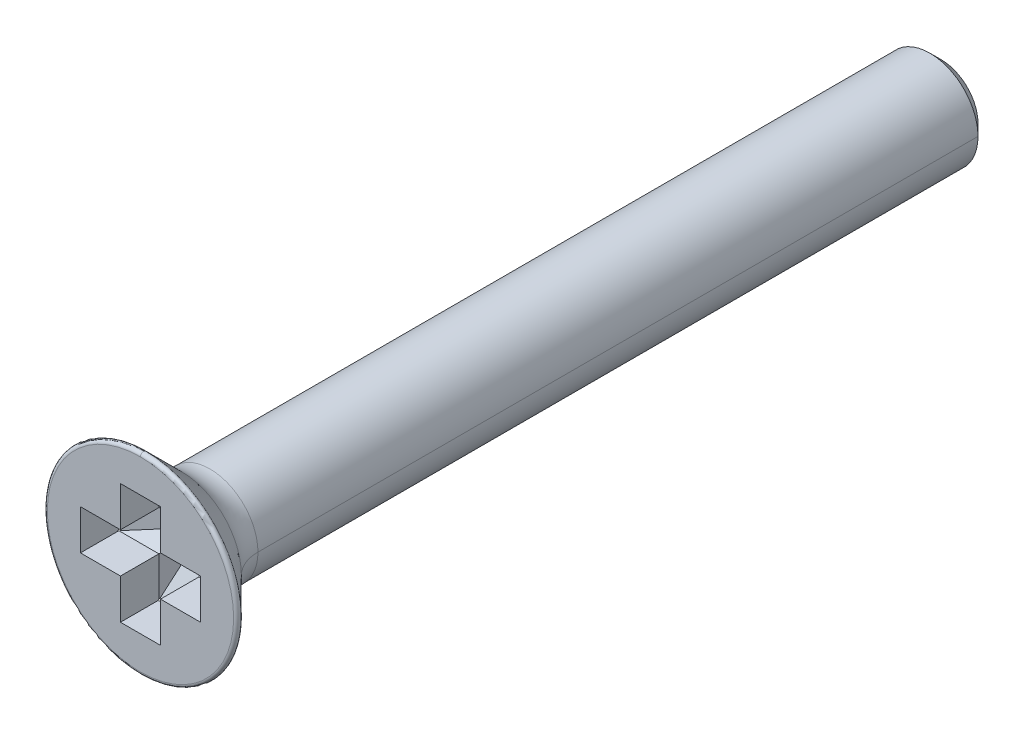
ISO-10303-21;
HEADER;
FILE_DESCRIPTION(('STEP AP214'),'2;1');
FILE_NAME('part.step','',(''),(''),'','','');
FILE_SCHEMA(('AUTOMOTIVE_DESIGN { 1 0 10303 214 1 1 1 1 }'));
ENDSEC;
DATA;
#1=APPLICATION_CONTEXT('core data for automotive mechanical design processes');
#2=APPLICATION_PROTOCOL_DEFINITION('international standard','automotive_design',2000,#1);
#3=PRODUCT_CONTEXT('',#1,'mechanical');
#4=PRODUCT('Part','Part','',(#3));
#5=PRODUCT_RELATED_PRODUCT_CATEGORY('part','',(#4));
#6=PRODUCT_DEFINITION_FORMATION('','',#4);
#7=PRODUCT_DEFINITION_CONTEXT('part definition',#1,'design');
#8=PRODUCT_DEFINITION('design','',#6,#7);
#9=PRODUCT_DEFINITION_SHAPE('','',#8);
#10=(LENGTH_UNIT() NAMED_UNIT(*) SI_UNIT(.MILLI.,.METRE.));
#11=(NAMED_UNIT(*) PLANE_ANGLE_UNIT() SI_UNIT($,.RADIAN.));
#12=(NAMED_UNIT(*) SI_UNIT($,.STERADIAN.) SOLID_ANGLE_UNIT());
#13=UNCERTAINTY_MEASURE_WITH_UNIT(LENGTH_MEASURE(1.E-05),#10,'distance_accuracy_value','');
#14=(GEOMETRIC_REPRESENTATION_CONTEXT(3) GLOBAL_UNCERTAINTY_ASSIGNED_CONTEXT((#13)) GLOBAL_UNIT_ASSIGNED_CONTEXT((#10,
#11,#12)) REPRESENTATION_CONTEXT('',''));
#15=CARTESIAN_POINT('',(0.,0.,0.));
#16=DIRECTION('',(0.,0.,1.));
#17=DIRECTION('',(1.,0.,0.));
#18=AXIS2_PLACEMENT_3D('',#15,#16,#17);
#19=CARTESIAN_POINT('',(0.,0.,0.));
#20=DIRECTION('',(0.,0.,1.));
#21=DIRECTION('',(1.,0.,0.));
#22=AXIS2_PLACEMENT_3D('',#19,#20,#21);
#23=CYLINDRICAL_SURFACE('',#22,1.5);
#24=DIRECTION('',(1.42416995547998E-07,9.7186200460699E-12,1.));
#25=VECTOR('',#24,1.);
#26=CARTESIAN_POINT('',(1.499996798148,-2.352520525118E-10,0.3500032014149));
#27=LINE('',#26,#25);
#28=CARTESIAN_POINT('',(1.5,0.,0.3500017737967));
#29=VERTEX_POINT('',#28);
#30=CARTESIAN_POINT('',(1.5,0.,22.83223304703));
#31=VERTEX_POINT('',#30);
#32=EDGE_CURVE('E470',#29,#31,#27,.T.);
#33=ORIENTED_EDGE('',*,*,#32,.F.);
#34=CARTESIAN_POINT('',(0.,0.,0.3500017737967));
#35=DIRECTION('',(0.,0.,-1.));
#36=DIRECTION('',(-1.,0.,0.));
#37=AXIS2_PLACEMENT_3D('',#34,#35,#36);
#38=CIRCLE('',#37,1.5);
#39=CARTESIAN_POINT('',(-1.5,0.,0.3500017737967));
#40=VERTEX_POINT('',#39);
#41=EDGE_CURVE('E461',#40,#29,#38,.T.);
#42=ORIENTED_EDGE('',*,*,#41,.F.);
#43=DIRECTION('',(-1.42416995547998E-07,-9.9670597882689E-12,1.));
#44=VECTOR('',#43,1.);
#45=CARTESIAN_POINT('',(-1.499996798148,2.352518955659E-10,0.3500032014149));
#46=LINE('',#45,#44);
#47=CARTESIAN_POINT('',(-1.5,0.,22.83223304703));
#48=VERTEX_POINT('',#47);
#49=EDGE_CURVE('E475',#40,#48,#46,.T.);
#50=ORIENTED_EDGE('',*,*,#49,.T.);
#51=CARTESIAN_POINT('',(0.,0.,22.83223304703));
#52=DIRECTION('',(0.,0.,-1.));
#53=DIRECTION('',(-1.,0.,0.));
#54=AXIS2_PLACEMENT_3D('',#51,#52,#53);
#55=CIRCLE('',#54,1.5);
#56=EDGE_CURVE('E223',#48,#31,#55,.T.);
#57=ORIENTED_EDGE('',*,*,#56,.T.);
#58=EDGE_LOOP('',(#33,#42,#50,#57));
#59=FACE_BOUND('',#58,.T.);
#60=ADVANCED_FACE('F16',(#59),#23,.T.);
#61=CARTESIAN_POINT('',(0.,0.,22.83223304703));
#62=DIRECTION('',(0.,0.,1.));
#63=DIRECTION('',(-0.0249329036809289,-0.999689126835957,0.));
#64=AXIS2_PLACEMENT_3D('',#61,#62,#63);
#65=TOROIDAL_SURFACE('',#64,2.75,1.25);
#66=CARTESIAN_POINT('',(2.75,-1.11419601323E-09,22.83223304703));
#67=DIRECTION('',(4.05162185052E-10,1.,0.));
#68=DIRECTION('',(-1.,4.05162185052E-10,0.));
#69=AXIS2_PLACEMENT_3D('',#66,#67,#68);
#70=CIRCLE('',#69,1.25);
#71=CARTESIAN_POINT('',(1.866116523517,0.,23.71611652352));
#72=VERTEX_POINT('',#71);
#73=EDGE_CURVE('E376',#31,#72,#70,.T.);
#74=ORIENTED_EDGE('',*,*,#73,.T.);
#75=CARTESIAN_POINT('',(0.,0.,23.71611652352));
#76=DIRECTION('',(0.,0.,1.));
#77=DIRECTION('',(0.,-1.,0.));
#78=AXIS2_PLACEMENT_3D('',#75,#76,#77);
#79=CIRCLE('',#78,1.866116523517);
#80=CARTESIAN_POINT('',(0.,-1.866116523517,23.71611652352));
#81=VERTEX_POINT('',#80);
#82=EDGE_CURVE('E392',#81,#72,#79,.T.);
#83=ORIENTED_EDGE('',*,*,#82,.F.);
#84=CARTESIAN_POINT('',(-9.33527505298E-10,-2.75,22.83223304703));
#85=DIRECTION('',(1.,-3.394645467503E-10,0.));
#86=DIRECTION('',(3.394645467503E-10,1.,0.));
#87=AXIS2_PLACEMENT_3D('',#84,#85,#86);
#88=CIRCLE('',#87,1.25);
#89=CARTESIAN_POINT('',(0.,-1.5,22.83223304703));
#90=VERTEX_POINT('',#89);
#91=EDGE_CURVE('E210',#90,#81,#88,.T.);
#92=ORIENTED_EDGE('',*,*,#91,.F.);
#93=CARTESIAN_POINT('',(0.,0.,22.83223304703));
#94=DIRECTION('',(0.,0.,1.));
#95=DIRECTION('',(0.,-1.,0.));
#96=AXIS2_PLACEMENT_3D('',#93,#94,#95);
#97=CIRCLE('',#96,1.5);
#98=EDGE_CURVE('E474',#90,#31,#97,.T.);
#99=ORIENTED_EDGE('',*,*,#98,.T.);
#100=EDGE_LOOP('',(#74,#83,#92,#99));
#101=FACE_BOUND('',#100,.T.);
#102=ADVANCED_FACE('F1082',(#101),#65,.F.);
#103=CARTESIAN_POINT('',(0.,0.,24.9));
#104=DIRECTION('',(0.,0.,-1.));
#105=DIRECTION('',(0.023113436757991,0.999732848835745,0.));
#106=AXIS2_PLACEMENT_3D('',#103,#104,#105);
#107=TOROIDAL_SURFACE('',#106,2.908578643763,0.1);
#108=CARTESIAN_POINT('',(0.,2.908578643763,24.9));
#109=DIRECTION('',(-1.,0.,0.));
#110=DIRECTION('',(0.,0.,1.));
#111=AXIS2_PLACEMENT_3D('',#108,#109,#110);
#112=CIRCLE('',#111,0.1);
#113=CARTESIAN_POINT('',(0.,2.908578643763,25.));
#114=VERTEX_POINT('',#113);
#115=CARTESIAN_POINT('',(0.,2.979289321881,24.82928932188));
#116=VERTEX_POINT('',#115);
#117=EDGE_CURVE('E10',#114,#116,#112,.T.);
#118=ORIENTED_EDGE('',*,*,#117,.T.);
#119=CARTESIAN_POINT('',(0.,0.,24.82928932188));
#120=DIRECTION('',(0.,0.,1.));
#121=DIRECTION('',(0.,1.,0.));
#122=AXIS2_PLACEMENT_3D('',#119,#120,#121);
#123=CIRCLE('',#122,2.979289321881);
#124=CARTESIAN_POINT('',(0.,-2.979289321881,24.82928932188));
#125=VERTEX_POINT('',#124);
#126=EDGE_CURVE('E599',#116,#125,#123,.T.);
#127=ORIENTED_EDGE('',*,*,#126,.T.);
#128=CARTESIAN_POINT('',(0.,-2.908578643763,24.9));
#129=DIRECTION('',(1.,0.,0.));
#130=DIRECTION('',(0.,0.,1.));
#131=AXIS2_PLACEMENT_3D('',#128,#129,#130);
#132=CIRCLE('',#131,0.1);
#133=CARTESIAN_POINT('',(0.,-2.908578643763,25.));
#134=VERTEX_POINT('',#133);
#135=EDGE_CURVE('E29',#134,#125,#132,.T.);
#136=ORIENTED_EDGE('',*,*,#135,.F.);
#137=CARTESIAN_POINT('',(0.,0.,25.));
#138=DIRECTION('',(0.,0.,1.));
#139=DIRECTION('',(0.,1.,0.));
#140=AXIS2_PLACEMENT_3D('',#137,#138,#139);
#141=CIRCLE('',#140,2.908578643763);
#142=EDGE_CURVE('E506',#114,#134,#141,.T.);
#143=ORIENTED_EDGE('',*,*,#142,.F.);
#144=EDGE_LOOP('',(#118,#127,#136,#143));
#145=FACE_BOUND('',#144,.T.);
#146=ADVANCED_FACE('F846',(#145),#107,.T.);
#147=CARTESIAN_POINT('',(0.,0.,24.9));
#148=DIRECTION('',(0.,0.,-1.));
#149=DIRECTION('',(-0.023113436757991,-0.999732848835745,0.));
#150=AXIS2_PLACEMENT_3D('',#147,#148,#149);
#151=TOROIDAL_SURFACE('',#150,2.908578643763,0.1);
#152=ORIENTED_EDGE('',*,*,#135,.T.);
#153=CARTESIAN_POINT('',(0.,0.,24.82928932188));
#154=DIRECTION('',(0.,0.,1.));
#155=DIRECTION('',(0.,-1.,0.));
#156=AXIS2_PLACEMENT_3D('',#153,#154,#155);
#157=CIRCLE('',#156,2.979289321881);
#158=EDGE_CURVE('E384',#125,#116,#157,.T.);
#159=ORIENTED_EDGE('',*,*,#158,.T.);
#160=ORIENTED_EDGE('',*,*,#117,.F.);
#161=CARTESIAN_POINT('',(0.,0.,25.));
#162=DIRECTION('',(0.,0.,1.));
#163=DIRECTION('',(0.,-1.,0.));
#164=AXIS2_PLACEMENT_3D('',#161,#162,#163);
#165=CIRCLE('',#164,2.908578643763);
#166=EDGE_CURVE('E501',#134,#114,#165,.T.);
#167=ORIENTED_EDGE('',*,*,#166,.F.);
#168=EDGE_LOOP('',(#152,#159,#160,#167));
#169=FACE_BOUND('',#168,.T.);
#170=ADVANCED_FACE('F839',(#169),#151,.T.);
#171=CARTESIAN_POINT('',(-1.875,-0.625,25.));
#172=DIRECTION('',(0.,-1.,0.));
#173=DIRECTION('',(0.,0.,-1.));
#174=AXIS2_PLACEMENT_3D('',#171,#172,#173);
#175=PLANE('',#174);
#176=CARTESIAN_POINT('',(-1.847126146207,-0.625,23.8));
#177=CARTESIAN_POINT('',(-1.851756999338,-0.625,23.80438654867));
#178=CARTESIAN_POINT('',(-1.861033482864,-0.625,23.81317703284));
#179=CARTESIAN_POINT('',(-1.8703395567,-0.625,23.82200225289));
#180=CARTESIAN_POINT('',(-1.875,-0.625,23.82642353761));
#181=(BOUNDED_CURVE() B_SPLINE_CURVE(3,(#176,#177,#178,#179,#180),.UNSPECIFIED.,.F.,
.F.) B_SPLINE_CURVE_WITH_KNOTS((4,1,4),(0.,0.5,1.),
.UNSPECIFIED.) CURVE() GEOMETRIC_REPRESENTATION_ITEM() RATIONAL_B_SPLINE_CURVE((1.,1.,1.,1.,1.)) REPRESENTATION_ITEM(''));
#182=CARTESIAN_POINT('',(-1.847126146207,-0.625,23.8));
#183=VERTEX_POINT('',#182);
#184=CARTESIAN_POINT('',(-1.875,-0.625,23.82642353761));
#185=VERTEX_POINT('',#184);
#186=EDGE_CURVE('E460',#183,#185,#181,.T.);
#187=ORIENTED_EDGE('',*,*,#186,.T.);
#188=DIRECTION('',(0.,0.,-1.));
#189=VECTOR('',#188,1.);
#190=CARTESIAN_POINT('',(-1.875,-0.625,25.));
#191=LINE('',#190,#189);
#192=CARTESIAN_POINT('',(-1.875,-0.625,25.));
#193=VERTEX_POINT('',#192);
#194=EDGE_CURVE('E411',#193,#185,#191,.T.);
#195=ORIENTED_EDGE('',*,*,#194,.F.);
#196=DIRECTION('',(1.,0.,0.));
#197=VECTOR('',#196,1.);
#198=CARTESIAN_POINT('',(-1.875,-0.625,25.));
#199=LINE('',#198,#197);
#200=CARTESIAN_POINT('',(-0.625,-0.625,25.));
#201=VERTEX_POINT('',#200);
#202=EDGE_CURVE('E505',#193,#201,#199,.T.);
#203=ORIENTED_EDGE('',*,*,#202,.T.);
#204=DIRECTION('',(0.,0.,-1.));
#205=VECTOR('',#204,1.);
#206=CARTESIAN_POINT('',(-0.625,-0.625,25.));
#207=LINE('',#206,#205);
#208=CARTESIAN_POINT('',(-0.625,-0.625,23.8));
#209=VERTEX_POINT('',#208);
#210=EDGE_CURVE('E432',#201,#209,#207,.T.);
#211=ORIENTED_EDGE('',*,*,#210,.T.);
#212=DIRECTION('',(1.,0.,0.));
#213=VECTOR('',#212,1.);
#214=CARTESIAN_POINT('',(-1.847126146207,-0.625,23.8));
#215=LINE('',#214,#213);
#216=EDGE_CURVE('E579',#183,#209,#215,.T.);
#217=ORIENTED_EDGE('',*,*,#216,.F.);
#218=EDGE_LOOP('',(#187,#195,#203,#211,#217));
#219=FACE_BOUND('',#218,.T.);
#220=ADVANCED_FACE('F1007',(#219),#175,.F.);
#221=CARTESIAN_POINT('',(-0.6416666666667,-0.3208333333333,23.4));
#222=DIRECTION('',(0.,-0.796002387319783,-0.605293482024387));
#223=DIRECTION('',(0.,0.605293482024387,-0.796002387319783));
#224=AXIS2_PLACEMENT_3D('',#221,#222,#223);
#225=PLANE('',#224);
#226=DIRECTION('',(-0.517821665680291,-0.517821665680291,0.680970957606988));
#227=VECTOR('',#226,1.);
#228=CARTESIAN_POINT('',(-0.01666666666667,-0.01666666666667,23.));
#229=LINE('',#228,#227);
#230=CARTESIAN_POINT('',(-0.01666666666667,-0.01666666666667,23.));
#231=VERTEX_POINT('',#230);
#232=EDGE_CURVE('E654',#231,#209,#229,.T.);
#233=ORIENTED_EDGE('',*,*,#232,.F.);
#234=DIRECTION('',(1.,0.,0.));
#235=VECTOR('',#234,1.);
#236=CARTESIAN_POINT('',(-0.05,-0.01666666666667,23.));
#237=LINE('',#236,#235);
#238=CARTESIAN_POINT('',(-0.05,-0.01666666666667,23.));
#239=VERTEX_POINT('',#238);
#240=EDGE_CURVE('E682',#239,#231,#237,.T.);
#241=ORIENTED_EDGE('',*,*,#240,.F.);
#242=DIRECTION('',(-0.875957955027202,-0.291985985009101,0.383981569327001));
#243=VECTOR('',#242,1.);
#244=CARTESIAN_POINT('',(-0.05,-0.01666666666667,23.));
#245=LINE('',#244,#243);
#246=CARTESIAN_POINT('',(-1.832086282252,-0.6106954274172,23.78118850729));
#247=VERTEX_POINT('',#246);
#248=EDGE_CURVE('E410',#239,#247,#245,.T.);
#249=ORIENTED_EDGE('',*,*,#248,.T.);
#250=CARTESIAN_POINT('',(-1.847126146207,-0.625,23.8));
#251=CARTESIAN_POINT('',(-1.844615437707,-0.6226087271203,23.79685531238));
#252=CARTESIAN_POINT('',(-1.839598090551,-0.6178333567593,23.79057537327));
#253=CARTESIAN_POINT('',(-1.83458886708,-0.6130723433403,23.78431431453));
#254=CARTESIAN_POINT('',(-1.832086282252,-0.6106954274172,23.78118850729));
#255=(BOUNDED_CURVE() B_SPLINE_CURVE(3,(#250,#251,#252,#253,#254),.UNSPECIFIED.,.F.,
.F.) B_SPLINE_CURVE_WITH_KNOTS((4,1,4),(0.,0.5,1.),
.UNSPECIFIED.) CURVE() GEOMETRIC_REPRESENTATION_ITEM() RATIONAL_B_SPLINE_CURVE((1.,1.,1.,1.,1.)) REPRESENTATION_ITEM(''));
#256=EDGE_CURVE('E451',#183,#247,#255,.T.);
#257=ORIENTED_EDGE('',*,*,#256,.F.);
#258=ORIENTED_EDGE('',*,*,#216,.T.);
#259=EDGE_LOOP('',(#233,#241,#249,#257,#258));
#260=FACE_BOUND('',#259,.T.);
#261=ADVANCED_FACE('F1011',(#260),#225,.F.);
#262=CARTESIAN_POINT('',(-0.9625,0.,23.4));
#263=DIRECTION('',(-0.40147688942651,0.,-0.915869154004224));
#264=DIRECTION('',(-0.915869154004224,0.,0.40147688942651));
#265=AXIS2_PLACEMENT_3D('',#262,#263,#264);
#266=PLANE('',#265);
#267=CARTESIAN_POINT('',(-1.832086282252,-0.6106954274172,23.78118850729));
#268=CARTESIAN_POINT('',(-1.847238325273,-0.5862431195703,23.78783049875));
#269=CARTESIAN_POINT('',(-1.861552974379,-0.5612205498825,23.79410541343));
#270=CARTESIAN_POINT('',(-1.875,-0.5356071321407,23.8));
#271=(BOUNDED_CURVE() B_SPLINE_CURVE(3,(#267,#268,#269,#270),.UNSPECIFIED.,.F.,
.F.) B_SPLINE_CURVE_WITH_KNOTS((4,4),(0.,1.),
.UNSPECIFIED.) CURVE() GEOMETRIC_REPRESENTATION_ITEM() RATIONAL_B_SPLINE_CURVE((1.,1.,1.,1.)) REPRESENTATION_ITEM(''));
#272=CARTESIAN_POINT('',(-1.875,-0.5356071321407,23.8));
#273=VERTEX_POINT('',#272);
#274=EDGE_CURVE('E431',#247,#273,#271,.T.);
#275=ORIENTED_EDGE('',*,*,#274,.F.);
#276=ORIENTED_EDGE('',*,*,#248,.F.);
#277=DIRECTION('',(0.,-1.,0.));
#278=VECTOR('',#277,1.);
#279=CARTESIAN_POINT('',(-0.05,0.01666666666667,23.));
#280=LINE('',#279,#278);
#281=CARTESIAN_POINT('',(-0.05,0.01666666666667,23.));
#282=VERTEX_POINT('',#281);
#283=EDGE_CURVE('E518',#282,#239,#280,.T.);
#284=ORIENTED_EDGE('',*,*,#283,.F.);
#285=DIRECTION('',(-0.875957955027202,0.291985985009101,0.383981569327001));
#286=VECTOR('',#285,1.);
#287=CARTESIAN_POINT('',(-0.05,0.01666666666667,23.));
#288=LINE('',#287,#286);
#289=CARTESIAN_POINT('',(-1.832086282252,0.6106954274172,23.78118850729));
#290=VERTEX_POINT('',#289);
#291=EDGE_CURVE('E673',#282,#290,#288,.T.);
#292=ORIENTED_EDGE('',*,*,#291,.T.);
#293=CARTESIAN_POINT('',(-1.875,0.5356071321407,23.8));
#294=CARTESIAN_POINT('',(-1.861552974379,0.5612205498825,23.79410541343));
#295=CARTESIAN_POINT('',(-1.847238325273,0.5862431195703,23.78783049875));
#296=CARTESIAN_POINT('',(-1.832086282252,0.6106954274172,23.78118850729));
#297=(BOUNDED_CURVE() B_SPLINE_CURVE(3,(#293,#294,#295,#296),.UNSPECIFIED.,.F.,
.F.) B_SPLINE_CURVE_WITH_KNOTS((4,4),(0.,1.),
.UNSPECIFIED.) CURVE() GEOMETRIC_REPRESENTATION_ITEM() RATIONAL_B_SPLINE_CURVE((1.,1.,1.,1.)) REPRESENTATION_ITEM(''));
#298=CARTESIAN_POINT('',(-1.875,0.5356071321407,23.8));
#299=VERTEX_POINT('',#298);
#300=EDGE_CURVE('E636',#299,#290,#297,.T.);
#301=ORIENTED_EDGE('',*,*,#300,.F.);
#302=DIRECTION('',(0.,-1.,0.));
#303=VECTOR('',#302,1.);
#304=CARTESIAN_POINT('',(-1.875,0.5356071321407,23.8));
#305=LINE('',#304,#303);
#306=EDGE_CURVE('E407',#299,#273,#305,.T.);
#307=ORIENTED_EDGE('',*,*,#306,.T.);
#308=EDGE_LOOP('',(#275,#276,#284,#292,#301,#307));
#309=FACE_BOUND('',#308,.T.);
#310=ADVANCED_FACE('F989',(#309),#266,.F.);
#311=CARTESIAN_POINT('',(-1.875,0.625,25.));
#312=DIRECTION('',(-1.,0.,0.));
#313=DIRECTION('',(0.,0.,1.));
#314=AXIS2_PLACEMENT_3D('',#311,#312,#313);
#315=PLANE('',#314);
#316=CARTESIAN_POINT('',(-1.875,0.5356071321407,23.8));
#317=CARTESIAN_POINT('',(-1.875,0.5503446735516,23.80404796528));
#318=CARTESIAN_POINT('',(-1.875,0.5799816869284,23.81249736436));
#319=CARTESIAN_POINT('',(-1.875,0.6099406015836,23.82166133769));
#320=CARTESIAN_POINT('',(-1.875,0.625,23.82642353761));
#321=(BOUNDED_CURVE() B_SPLINE_CURVE(3,(#316,#317,#318,#319,#320),.UNSPECIFIED.,.F.,
.F.) B_SPLINE_CURVE_WITH_KNOTS((4,1,4),(0.,0.5,1.),
.UNSPECIFIED.) CURVE() GEOMETRIC_REPRESENTATION_ITEM() RATIONAL_B_SPLINE_CURVE((1.,1.,1.,1.,1.)) REPRESENTATION_ITEM(''));
#322=CARTESIAN_POINT('',(-1.875,0.625,23.82642353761));
#323=VERTEX_POINT('',#322);
#324=EDGE_CURVE('E630',#299,#323,#321,.T.);
#325=ORIENTED_EDGE('',*,*,#324,.T.);
#326=DIRECTION('',(0.,0.,-1.));
#327=VECTOR('',#326,1.);
#328=CARTESIAN_POINT('',(-1.875,0.625,25.));
#329=LINE('',#328,#327);
#330=CARTESIAN_POINT('',(-1.875,0.625,25.));
#331=VERTEX_POINT('',#330);
#332=EDGE_CURVE('E569',#331,#323,#329,.T.);
#333=ORIENTED_EDGE('',*,*,#332,.F.);
#334=DIRECTION('',(0.,-1.,0.));
#335=VECTOR('',#334,1.);
#336=CARTESIAN_POINT('',(-1.875,0.625,25.));
#337=LINE('',#336,#335);
#338=EDGE_CURVE('E417',#331,#193,#337,.T.);
#339=ORIENTED_EDGE('',*,*,#338,.T.);
#340=ORIENTED_EDGE('',*,*,#194,.T.);
#341=CARTESIAN_POINT('',(-1.875,-0.625,23.82642353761));
#342=CARTESIAN_POINT('',(-1.875,-0.6099421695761,23.82166183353));
#343=CARTESIAN_POINT('',(-1.875,-0.5799848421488,23.81249829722));
#344=CARTESIAN_POINT('',(-1.875,-0.5503462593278,23.80404840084));
#345=CARTESIAN_POINT('',(-1.875,-0.5356071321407,23.8));
#346=(BOUNDED_CURVE() B_SPLINE_CURVE(3,(#341,#342,#343,#344,#345),.UNSPECIFIED.,.F.,
.F.) B_SPLINE_CURVE_WITH_KNOTS((4,1,4),(0.,0.5,1.),
.UNSPECIFIED.) CURVE() GEOMETRIC_REPRESENTATION_ITEM() RATIONAL_B_SPLINE_CURVE((1.,1.,1.,1.,1.)) REPRESENTATION_ITEM(''));
#347=EDGE_CURVE('E598',#185,#273,#346,.T.);
#348=ORIENTED_EDGE('',*,*,#347,.T.);
#349=ORIENTED_EDGE('',*,*,#306,.F.);
#350=EDGE_LOOP('',(#325,#333,#339,#340,#348,#349));
#351=FACE_BOUND('',#350,.T.);
#352=ADVANCED_FACE('F985',(#351),#315,.F.);
#353=CARTESIAN_POINT('',(-0.625,0.625,25.));
#354=DIRECTION('',(0.,1.,0.));
#355=DIRECTION('',(1.,0.,0.));
#356=AXIS2_PLACEMENT_3D('',#353,#354,#355);
#357=PLANE('',#356);
#358=DIRECTION('',(0.,0.,-1.));
#359=VECTOR('',#358,1.);
#360=CARTESIAN_POINT('',(-0.625,0.625,25.));
#361=LINE('',#360,#359);
#362=CARTESIAN_POINT('',(-0.625,0.625,25.));
#363=VERTEX_POINT('',#362);
#364=CARTESIAN_POINT('',(-0.625,0.625,23.8));
#365=VERTEX_POINT('',#364);
#366=EDGE_CURVE('E568',#363,#365,#361,.T.);
#367=ORIENTED_EDGE('',*,*,#366,.F.);
#368=DIRECTION('',(-1.,0.,0.));
#369=VECTOR('',#368,1.);
#370=CARTESIAN_POINT('',(-0.625,0.625,25.));
#371=LINE('',#370,#369);
#372=EDGE_CURVE('E412',#363,#331,#371,.T.);
#373=ORIENTED_EDGE('',*,*,#372,.T.);
#374=ORIENTED_EDGE('',*,*,#332,.T.);
#375=CARTESIAN_POINT('',(-1.875,0.625,23.82642353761));
#376=CARTESIAN_POINT('',(-1.87034063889,0.625,23.82200327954));
#377=CARTESIAN_POINT('',(-1.861035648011,0.625,23.81317908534));
#378=CARTESIAN_POINT('',(-1.851758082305,0.625,23.8043875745));
#379=CARTESIAN_POINT('',(-1.847126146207,0.625,23.8));
#380=(BOUNDED_CURVE() B_SPLINE_CURVE(3,(#375,#376,#377,#378,#379),.UNSPECIFIED.,.F.,
.F.) B_SPLINE_CURVE_WITH_KNOTS((4,1,4),(0.,0.5,1.),
.UNSPECIFIED.) CURVE() GEOMETRIC_REPRESENTATION_ITEM() RATIONAL_B_SPLINE_CURVE((1.,1.,1.,1.,1.)) REPRESENTATION_ITEM(''));
#381=CARTESIAN_POINT('',(-1.847126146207,0.625,23.8));
#382=VERTEX_POINT('',#381);
#383=EDGE_CURVE('E637',#323,#382,#380,.T.);
#384=ORIENTED_EDGE('',*,*,#383,.T.);
#385=DIRECTION('',(1.,0.,0.));
#386=VECTOR('',#385,1.);
#387=CARTESIAN_POINT('',(-1.847126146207,0.625,23.8));
#388=LINE('',#387,#386);
#389=EDGE_CURVE('E43',#382,#365,#388,.T.);
#390=ORIENTED_EDGE('',*,*,#389,.T.);
#391=EDGE_LOOP('',(#367,#373,#374,#384,#390));
#392=FACE_BOUND('',#391,.T.);
#393=ADVANCED_FACE('F821',(#392),#357,.F.);
#394=CARTESIAN_POINT('',(-0.6416666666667,0.3208333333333,23.4));
#395=DIRECTION('',(0.,0.796002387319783,-0.605293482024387));
#396=DIRECTION('',(-1.,0.,0.));
#397=AXIS2_PLACEMENT_3D('',#394,#395,#396);
#398=PLANE('',#397);
#399=CARTESIAN_POINT('',(-1.832086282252,0.6106954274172,23.78118850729));
#400=CARTESIAN_POINT('',(-1.834588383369,0.6130718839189,23.78431371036));
#401=CARTESIAN_POINT('',(-1.83959712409,0.6178324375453,23.79057416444));
#402=CARTESIAN_POINT('',(-1.844614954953,0.6226082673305,23.79685470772));
#403=CARTESIAN_POINT('',(-1.847126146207,0.625,23.8));
#404=(BOUNDED_CURVE() B_SPLINE_CURVE(3,(#399,#400,#401,#402,#403),.UNSPECIFIED.,.F.,
.F.) B_SPLINE_CURVE_WITH_KNOTS((4,1,4),(0.,0.5,1.),
.UNSPECIFIED.) CURVE() GEOMETRIC_REPRESENTATION_ITEM() RATIONAL_B_SPLINE_CURVE((1.,1.,1.,1.,1.)) REPRESENTATION_ITEM(''));
#405=EDGE_CURVE('E758',#290,#382,#404,.T.);
#406=ORIENTED_EDGE('',*,*,#405,.F.);
#407=ORIENTED_EDGE('',*,*,#291,.F.);
#408=DIRECTION('',(-1.,0.,0.));
#409=VECTOR('',#408,1.);
#410=CARTESIAN_POINT('',(-0.01666666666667,0.01666666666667,23.));
#411=LINE('',#410,#409);
#412=CARTESIAN_POINT('',(-0.01666666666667,0.01666666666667,23.));
#413=VERTEX_POINT('',#412);
#414=EDGE_CURVE('E514',#413,#282,#411,.T.);
#415=ORIENTED_EDGE('',*,*,#414,.F.);
#416=DIRECTION('',(-0.517821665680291,0.517821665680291,0.680970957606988));
#417=VECTOR('',#416,1.);
#418=CARTESIAN_POINT('',(-0.01666666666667,0.01666666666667,23.));
#419=LINE('',#418,#417);
#420=EDGE_CURVE('E567',#413,#365,#419,.T.);
#421=ORIENTED_EDGE('',*,*,#420,.T.);
#422=ORIENTED_EDGE('',*,*,#389,.F.);
#423=EDGE_LOOP('',(#406,#407,#415,#421,#422));
#424=FACE_BOUND('',#423,.T.);
#425=ADVANCED_FACE('F809',(#424),#398,.F.);
#426=CARTESIAN_POINT('',(-0.3208333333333,0.6416666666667,23.4));
#427=DIRECTION('',(-0.796002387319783,0.,-0.605293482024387));
#428=DIRECTION('',(-0.605293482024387,0.,0.796002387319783));
#429=AXIS2_PLACEMENT_3D('',#426,#427,#428);
#430=PLANE('',#429);
#431=ORIENTED_EDGE('',*,*,#420,.F.);
#432=DIRECTION('',(0.,-1.,0.));
#433=VECTOR('',#432,1.);
#434=CARTESIAN_POINT('',(-0.01666666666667,0.05,23.));
#435=LINE('',#434,#433);
#436=CARTESIAN_POINT('',(-0.01666666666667,0.05,23.));
#437=VERTEX_POINT('',#436);
#438=EDGE_CURVE('E519',#437,#413,#435,.T.);
#439=ORIENTED_EDGE('',*,*,#438,.F.);
#440=DIRECTION('',(-0.291985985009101,0.875957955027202,0.383981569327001));
#441=VECTOR('',#440,1.);
#442=CARTESIAN_POINT('',(-0.01666666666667,0.05,23.));
#443=LINE('',#442,#441);
#444=CARTESIAN_POINT('',(-0.6106954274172,1.832086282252,23.78118850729));
#445=VERTEX_POINT('',#444);
#446=EDGE_CURVE('E443',#437,#445,#443,.T.);
#447=ORIENTED_EDGE('',*,*,#446,.T.);
#448=CARTESIAN_POINT('',(-0.625,1.847126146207,23.8));
#449=CARTESIAN_POINT('',(-0.6226087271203,1.844615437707,23.79685531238));
#450=CARTESIAN_POINT('',(-0.6178333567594,1.839598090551,23.79057537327));
#451=CARTESIAN_POINT('',(-0.6130723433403,1.83458886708,23.78431431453));
#452=CARTESIAN_POINT('',(-0.6106954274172,1.832086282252,23.78118850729));
#453=(BOUNDED_CURVE() B_SPLINE_CURVE(3,(#448,#449,#450,#451,#452),.UNSPECIFIED.,.F.,
.F.) B_SPLINE_CURVE_WITH_KNOTS((4,1,4),(0.,0.5,1.),
.UNSPECIFIED.) CURVE() GEOMETRIC_REPRESENTATION_ITEM() RATIONAL_B_SPLINE_CURVE((1.,1.,1.,1.,1.)) REPRESENTATION_ITEM(''));
#454=CARTESIAN_POINT('',(-0.625,1.847126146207,23.8));
#455=VERTEX_POINT('',#454);
#456=EDGE_CURVE('E689',#455,#445,#453,.T.);
#457=ORIENTED_EDGE('',*,*,#456,.F.);
#458=DIRECTION('',(0.,-1.,0.));
#459=VECTOR('',#458,1.);
#460=CARTESIAN_POINT('',(-0.625,1.847126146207,23.8));
#461=LINE('',#460,#459);
#462=EDGE_CURVE('E560',#455,#365,#461,.T.);
#463=ORIENTED_EDGE('',*,*,#462,.T.);
#464=EDGE_LOOP('',(#431,#439,#447,#457,#463));
#465=FACE_BOUND('',#464,.T.);
#466=ADVANCED_FACE('F815',(#465),#430,.F.);
#467=CARTESIAN_POINT('',(-0.625,1.875,25.));
#468=DIRECTION('',(-1.,0.,0.));
#469=DIRECTION('',(0.,0.,1.));
#470=AXIS2_PLACEMENT_3D('',#467,#468,#469);
#471=PLANE('',#470);
#472=CARTESIAN_POINT('',(-0.625,1.847126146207,23.8));
#473=CARTESIAN_POINT('',(-0.625,1.851756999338,23.80438654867));
#474=CARTESIAN_POINT('',(-0.625,1.861033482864,23.81317703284));
#475=CARTESIAN_POINT('',(-0.625,1.8703395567,23.82200225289));
#476=CARTESIAN_POINT('',(-0.625,1.875,23.82642353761));
#477=(BOUNDED_CURVE() B_SPLINE_CURVE(3,(#472,#473,#474,#475,#476),.UNSPECIFIED.,.F.,
.F.) B_SPLINE_CURVE_WITH_KNOTS((4,1,4),(0.,0.5,1.),
.UNSPECIFIED.) CURVE() GEOMETRIC_REPRESENTATION_ITEM() RATIONAL_B_SPLINE_CURVE((1.,1.,1.,1.,1.)) REPRESENTATION_ITEM(''));
#478=CARTESIAN_POINT('',(-0.625,1.875,23.82642353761));
#479=VERTEX_POINT('',#478);
#480=EDGE_CURVE('E683',#455,#479,#477,.T.);
#481=ORIENTED_EDGE('',*,*,#480,.T.);
#482=DIRECTION('',(0.,0.,-1.));
#483=VECTOR('',#482,1.);
#484=CARTESIAN_POINT('',(-0.625,1.875,25.));
#485=LINE('',#484,#483);
#486=CARTESIAN_POINT('',(-0.625,1.875,25.));
#487=VERTEX_POINT('',#486);
#488=EDGE_CURVE('E745',#487,#479,#485,.T.);
#489=ORIENTED_EDGE('',*,*,#488,.F.);
#490=DIRECTION('',(0.,-1.,0.));
#491=VECTOR('',#490,1.);
#492=CARTESIAN_POINT('',(-0.625,1.875,25.));
#493=LINE('',#492,#491);
#494=EDGE_CURVE('E416',#487,#363,#493,.T.);
#495=ORIENTED_EDGE('',*,*,#494,.T.);
#496=ORIENTED_EDGE('',*,*,#366,.T.);
#497=ORIENTED_EDGE('',*,*,#462,.F.);
#498=EDGE_LOOP('',(#481,#489,#495,#496,#497));
#499=FACE_BOUND('',#498,.T.);
#500=ADVANCED_FACE('F818',(#499),#471,.F.);
#501=CARTESIAN_POINT('',(0.625,1.875,25.));
#502=DIRECTION('',(0.,1.,0.));
#503=DIRECTION('',(1.,0.,0.));
#504=AXIS2_PLACEMENT_3D('',#501,#502,#503);
#505=PLANE('',#504);
#506=CARTESIAN_POINT('',(0.5356071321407,1.875,23.8));
#507=CARTESIAN_POINT('',(0.5503339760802,1.875,23.804045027));
#508=CARTESIAN_POINT('',(0.5799604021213,1.875,23.81249107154));
#509=CARTESIAN_POINT('',(0.6099300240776,1.875,23.82165799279));
#510=CARTESIAN_POINT('',(0.625,1.875,23.82642353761));
#511=(BOUNDED_CURVE() B_SPLINE_CURVE(3,(#506,#507,#508,#509,#510),.UNSPECIFIED.,.F.,
.F.) B_SPLINE_CURVE_WITH_KNOTS((4,1,4),(0.,0.5,1.),
.UNSPECIFIED.) CURVE() GEOMETRIC_REPRESENTATION_ITEM() RATIONAL_B_SPLINE_CURVE((1.,1.,1.,1.,1.)) REPRESENTATION_ITEM(''));
#512=CARTESIAN_POINT('',(0.5356071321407,1.875,23.8));
#513=VERTEX_POINT('',#512);
#514=CARTESIAN_POINT('',(0.625,1.875,23.82642353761));
#515=VERTEX_POINT('',#514);
#516=EDGE_CURVE('E362',#513,#515,#511,.T.);
#517=ORIENTED_EDGE('',*,*,#516,.T.);
#518=DIRECTION('',(0.,0.,-1.));
#519=VECTOR('',#518,1.);
#520=CARTESIAN_POINT('',(0.625,1.875,25.));
#521=LINE('',#520,#519);
#522=CARTESIAN_POINT('',(0.625,1.875,25.));
#523=VERTEX_POINT('',#522);
#524=EDGE_CURVE('E346',#523,#515,#521,.T.);
#525=ORIENTED_EDGE('',*,*,#524,.F.);
#526=DIRECTION('',(-1.,0.,0.));
#527=VECTOR('',#526,1.);
#528=CARTESIAN_POINT('',(0.625,1.875,25.));
#529=LINE('',#528,#527);
#530=EDGE_CURVE('E638',#523,#487,#529,.T.);
#531=ORIENTED_EDGE('',*,*,#530,.T.);
#532=ORIENTED_EDGE('',*,*,#488,.T.);
#533=CARTESIAN_POINT('',(-0.625,1.875,23.82642353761));
#534=CARTESIAN_POINT('',(-0.6099776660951,1.875,23.82167305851));
#535=CARTESIAN_POINT('',(-0.5800562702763,1.875,23.81251941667));
#536=CARTESIAN_POINT('',(-0.5503821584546,1.875,23.80405826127));
#537=CARTESIAN_POINT('',(-0.5356071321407,1.875,23.8));
#538=(BOUNDED_CURVE() B_SPLINE_CURVE(3,(#533,#534,#535,#536,#537),.UNSPECIFIED.,.F.,
.F.) B_SPLINE_CURVE_WITH_KNOTS((4,1,4),(0.,0.5,1.),
.UNSPECIFIED.) CURVE() GEOMETRIC_REPRESENTATION_ITEM() RATIONAL_B_SPLINE_CURVE((1.,1.,1.,1.,1.)) REPRESENTATION_ITEM(''));
#539=CARTESIAN_POINT('',(-0.5356071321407,1.875,23.8));
#540=VERTEX_POINT('',#539);
#541=EDGE_CURVE('E482',#479,#540,#538,.T.);
#542=ORIENTED_EDGE('',*,*,#541,.T.);
#543=DIRECTION('',(-1.,0.,0.));
#544=VECTOR('',#543,1.);
#545=CARTESIAN_POINT('',(0.5356071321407,1.875,23.8));
#546=LINE('',#545,#544);
#547=EDGE_CURVE('E629',#513,#540,#546,.T.);
#548=ORIENTED_EDGE('',*,*,#547,.F.);
#549=EDGE_LOOP('',(#517,#525,#531,#532,#542,#548));
#550=FACE_BOUND('',#549,.T.);
#551=ADVANCED_FACE('F1002',(#550),#505,.F.);
#552=CARTESIAN_POINT('',(0.,0.9625,23.4));
#553=DIRECTION('',(0.,0.40147688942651,-0.915869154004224));
#554=DIRECTION('',(-1.,0.,0.));
#555=AXIS2_PLACEMENT_3D('',#552,#553,#554);
#556=PLANE('',#555);
#557=CARTESIAN_POINT('',(-0.6106954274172,1.832086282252,23.78118850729));
#558=CARTESIAN_POINT('',(-0.5862431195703,1.847238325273,23.78783049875));
#559=CARTESIAN_POINT('',(-0.5612205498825,1.861552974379,23.79410541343));
#560=CARTESIAN_POINT('',(-0.5356071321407,1.875,23.8));
#561=(BOUNDED_CURVE() B_SPLINE_CURVE(3,(#557,#558,#559,#560),.UNSPECIFIED.,.F.,
.F.) B_SPLINE_CURVE_WITH_KNOTS((4,4),(0.,1.),
.UNSPECIFIED.) CURVE() GEOMETRIC_REPRESENTATION_ITEM() RATIONAL_B_SPLINE_CURVE((1.,1.,1.,1.)) REPRESENTATION_ITEM(''));
#562=EDGE_CURVE('E720',#445,#540,#561,.T.);
#563=ORIENTED_EDGE('',*,*,#562,.F.);
#564=ORIENTED_EDGE('',*,*,#446,.F.);
#565=DIRECTION('',(-1.,0.,0.));
#566=VECTOR('',#565,1.);
#567=CARTESIAN_POINT('',(0.01666666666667,0.05,23.));
#568=LINE('',#567,#566);
#569=CARTESIAN_POINT('',(0.01666666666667,0.05,23.));
#570=VERTEX_POINT('',#569);
#571=EDGE_CURVE('E672',#570,#437,#568,.T.);
#572=ORIENTED_EDGE('',*,*,#571,.F.);
#573=DIRECTION('',(0.291985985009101,0.875957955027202,0.383981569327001));
#574=VECTOR('',#573,1.);
#575=CARTESIAN_POINT('',(0.01666666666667,0.05,23.));
#576=LINE('',#575,#574);
#577=CARTESIAN_POINT('',(0.6106954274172,1.832086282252,23.78118850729));
#578=VERTEX_POINT('',#577);
#579=EDGE_CURVE('E345',#570,#578,#576,.T.);
#580=ORIENTED_EDGE('',*,*,#579,.T.);
#581=CARTESIAN_POINT('',(0.5356071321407,1.875,23.8));
#582=CARTESIAN_POINT('',(0.5612205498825,1.861552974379,23.79410541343));
#583=CARTESIAN_POINT('',(0.5862431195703,1.847238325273,23.78783049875));
#584=CARTESIAN_POINT('',(0.6106954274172,1.832086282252,23.78118850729));
#585=(BOUNDED_CURVE() B_SPLINE_CURVE(3,(#581,#582,#583,#584),.UNSPECIFIED.,.F.,
.F.) B_SPLINE_CURVE_WITH_KNOTS((4,4),(0.,1.),
.UNSPECIFIED.) CURVE() GEOMETRIC_REPRESENTATION_ITEM() RATIONAL_B_SPLINE_CURVE((1.,1.,1.,1.)) REPRESENTATION_ITEM(''));
#586=EDGE_CURVE('E20',#513,#578,#585,.T.);
#587=ORIENTED_EDGE('',*,*,#586,.F.);
#588=ORIENTED_EDGE('',*,*,#547,.T.);
#589=EDGE_LOOP('',(#563,#564,#572,#580,#587,#588));
#590=FACE_BOUND('',#589,.T.);
#591=ADVANCED_FACE('F997',(#590),#556,.F.);
#592=CARTESIAN_POINT('',(0.3208333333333,0.6416666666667,23.4));
#593=DIRECTION('',(0.796002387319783,0.,-0.605293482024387));
#594=DIRECTION('',(0.,-1.,0.));
#595=AXIS2_PLACEMENT_3D('',#592,#593,#594);
#596=PLANE('',#595);
#597=CARTESIAN_POINT('',(0.6106954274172,1.832086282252,23.78118850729));
#598=CARTESIAN_POINT('',(0.6130718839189,1.834588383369,23.78431371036));
#599=CARTESIAN_POINT('',(0.6178324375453,1.83959712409,23.79057416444));
#600=CARTESIAN_POINT('',(0.6226082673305,1.844614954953,23.79685470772));
#601=CARTESIAN_POINT('',(0.625,1.847126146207,23.8));
#602=(BOUNDED_CURVE() B_SPLINE_CURVE(3,(#597,#598,#599,#600,#601),.UNSPECIFIED.,.F.,
.F.) B_SPLINE_CURVE_WITH_KNOTS((4,1,4),(0.,0.5,1.),
.UNSPECIFIED.) CURVE() GEOMETRIC_REPRESENTATION_ITEM() RATIONAL_B_SPLINE_CURVE((1.,1.,1.,1.,1.)) REPRESENTATION_ITEM(''));
#603=CARTESIAN_POINT('',(0.625,1.847126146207,23.8));
#604=VERTEX_POINT('',#603);
#605=EDGE_CURVE('E336',#578,#604,#602,.T.);
#606=ORIENTED_EDGE('',*,*,#605,.F.);
#607=ORIENTED_EDGE('',*,*,#579,.F.);
#608=DIRECTION('',(0.,1.,0.));
#609=VECTOR('',#608,1.);
#610=CARTESIAN_POINT('',(0.01666666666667,0.01666666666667,23.));
#611=LINE('',#610,#609);
#612=CARTESIAN_POINT('',(0.01666666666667,0.01666666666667,23.));
#613=VERTEX_POINT('',#612);
#614=EDGE_CURVE('E397',#613,#570,#611,.T.);
#615=ORIENTED_EDGE('',*,*,#614,.F.);
#616=DIRECTION('',(0.517821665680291,0.517821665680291,0.680970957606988));
#617=VECTOR('',#616,1.);
#618=CARTESIAN_POINT('',(0.01666666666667,0.01666666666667,23.));
#619=LINE('',#618,#617);
#620=CARTESIAN_POINT('',(0.625,0.625,23.8));
#621=VERTEX_POINT('',#620);
#622=EDGE_CURVE('E339',#613,#621,#619,.T.);
#623=ORIENTED_EDGE('',*,*,#622,.T.);
#624=DIRECTION('',(0.,-1.,0.));
#625=VECTOR('',#624,1.);
#626=CARTESIAN_POINT('',(0.625,1.847126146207,23.8));
#627=LINE('',#626,#625);
#628=EDGE_CURVE('E333',#604,#621,#627,.T.);
#629=ORIENTED_EDGE('',*,*,#628,.F.);
#630=EDGE_LOOP('',(#606,#607,#615,#623,#629));
#631=FACE_BOUND('',#630,.T.);
#632=ADVANCED_FACE('F335',(#631),#596,.F.);
#633=CARTESIAN_POINT('',(0.625,0.625,25.));
#634=DIRECTION('',(1.,0.,0.));
#635=DIRECTION('',(0.,1.,0.));
#636=AXIS2_PLACEMENT_3D('',#633,#634,#635);
#637=PLANE('',#636);
#638=DIRECTION('',(0.,0.,-1.));
#639=VECTOR('',#638,1.);
#640=CARTESIAN_POINT('',(0.625,0.625,25.));
#641=LINE('',#640,#639);
#642=CARTESIAN_POINT('',(0.625,0.625,25.));
#643=VERTEX_POINT('',#642);
#644=EDGE_CURVE('E406',#643,#621,#641,.T.);
#645=ORIENTED_EDGE('',*,*,#644,.F.);
#646=DIRECTION('',(0.,1.,0.));
#647=VECTOR('',#646,1.);
#648=CARTESIAN_POINT('',(0.625,0.625,25.));
#649=LINE('',#648,#647);
#650=EDGE_CURVE('E645',#643,#523,#649,.T.);
#651=ORIENTED_EDGE('',*,*,#650,.T.);
#652=ORIENTED_EDGE('',*,*,#524,.T.);
#653=CARTESIAN_POINT('',(0.625,1.875,23.82642353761));
#654=CARTESIAN_POINT('',(0.625,1.87034063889,23.82200327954));
#655=CARTESIAN_POINT('',(0.625,1.861035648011,23.81317908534));
#656=CARTESIAN_POINT('',(0.625,1.851758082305,23.8043875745));
#657=CARTESIAN_POINT('',(0.625,1.847126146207,23.8));
#658=(BOUNDED_CURVE() B_SPLINE_CURVE(3,(#653,#654,#655,#656,#657),.UNSPECIFIED.,.F.,
.F.) B_SPLINE_CURVE_WITH_KNOTS((4,1,4),(0.,0.5,1.),
.UNSPECIFIED.) CURVE() GEOMETRIC_REPRESENTATION_ITEM() RATIONAL_B_SPLINE_CURVE((1.,1.,1.,1.,1.)) REPRESENTATION_ITEM(''));
#659=EDGE_CURVE('E353',#515,#604,#658,.T.);
#660=ORIENTED_EDGE('',*,*,#659,.T.);
#661=ORIENTED_EDGE('',*,*,#628,.T.);
#662=EDGE_LOOP('',(#645,#651,#652,#660,#661));
#663=FACE_BOUND('',#662,.T.);
#664=ADVANCED_FACE('F358',(#663),#637,.F.);
#665=CARTESIAN_POINT('',(1.875,0.625,25.));
#666=DIRECTION('',(0.,1.,0.));
#667=DIRECTION('',(1.,0.,0.));
#668=AXIS2_PLACEMENT_3D('',#665,#666,#667);
#669=PLANE('',#668);
#670=CARTESIAN_POINT('',(1.847126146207,0.625,23.8));
#671=CARTESIAN_POINT('',(1.851756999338,0.625,23.80438654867));
#672=CARTESIAN_POINT('',(1.861033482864,0.625,23.81317703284));
#673=CARTESIAN_POINT('',(1.8703395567,0.625,23.82200225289));
#674=CARTESIAN_POINT('',(1.875,0.625,23.82642353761));
#675=(BOUNDED_CURVE() B_SPLINE_CURVE(3,(#670,#671,#672,#673,#674),.UNSPECIFIED.,.F.,
.F.) B_SPLINE_CURVE_WITH_KNOTS((4,1,4),(0.,0.5,1.),
.UNSPECIFIED.) CURVE() GEOMETRIC_REPRESENTATION_ITEM() RATIONAL_B_SPLINE_CURVE((1.,1.,1.,1.,1.)) REPRESENTATION_ITEM(''));
#676=CARTESIAN_POINT('',(1.847126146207,0.625,23.8));
#677=VERTEX_POINT('',#676);
#678=CARTESIAN_POINT('',(1.875,0.625,23.82642353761));
#679=VERTEX_POINT('',#678);
#680=EDGE_CURVE('E444',#677,#679,#675,.T.);
#681=ORIENTED_EDGE('',*,*,#680,.T.);
#682=DIRECTION('',(0.,0.,-1.));
#683=VECTOR('',#682,1.);
#684=CARTESIAN_POINT('',(1.875,0.625,25.));
#685=LINE('',#684,#683);
#686=CARTESIAN_POINT('',(1.875,0.625,25.));
#687=VERTEX_POINT('',#686);
#688=EDGE_CURVE('E778',#687,#679,#685,.T.);
#689=ORIENTED_EDGE('',*,*,#688,.F.);
#690=DIRECTION('',(-1.,0.,0.));
#691=VECTOR('',#690,1.);
#692=CARTESIAN_POINT('',(1.875,0.625,25.));
#693=LINE('',#692,#691);
#694=EDGE_CURVE('E775',#687,#643,#693,.T.);
#695=ORIENTED_EDGE('',*,*,#694,.T.);
#696=ORIENTED_EDGE('',*,*,#644,.T.);
#697=DIRECTION('',(-1.,0.,0.));
#698=VECTOR('',#697,1.);
#699=CARTESIAN_POINT('',(1.847126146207,0.625,23.8));
#700=LINE('',#699,#698);
#701=EDGE_CURVE('E401',#677,#621,#700,.T.);
#702=ORIENTED_EDGE('',*,*,#701,.F.);
#703=EDGE_LOOP('',(#681,#689,#695,#696,#702));
#704=FACE_BOUND('',#703,.T.);
#705=ADVANCED_FACE('F1060',(#704),#669,.F.);
#706=CARTESIAN_POINT('',(0.6416666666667,0.3208333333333,23.4));
#707=DIRECTION('',(0.,0.796002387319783,-0.605293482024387));
#708=DIRECTION('',(-1.,0.,0.));
#709=AXIS2_PLACEMENT_3D('',#706,#707,#708);
#710=PLANE('',#709);
#711=ORIENTED_EDGE('',*,*,#622,.F.);
#712=DIRECTION('',(-1.,0.,0.));
#713=VECTOR('',#712,1.);
#714=CARTESIAN_POINT('',(0.05,0.01666666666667,23.));
#715=LINE('',#714,#713);
#716=CARTESIAN_POINT('',(0.05,0.01666666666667,23.));
#717=VERTEX_POINT('',#716);
#718=EDGE_CURVE('E393',#717,#613,#715,.T.);
#719=ORIENTED_EDGE('',*,*,#718,.F.);
#720=DIRECTION('',(0.875957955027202,0.291985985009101,0.383981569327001));
#721=VECTOR('',#720,1.);
#722=CARTESIAN_POINT('',(0.05,0.01666666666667,23.));
#723=LINE('',#722,#721);
#724=CARTESIAN_POINT('',(1.832086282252,0.6106954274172,23.78118850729));
#725=VERTEX_POINT('',#724);
#726=EDGE_CURVE('E402',#717,#725,#723,.T.);
#727=ORIENTED_EDGE('',*,*,#726,.T.);
#728=CARTESIAN_POINT('',(1.847126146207,0.625,23.8));
#729=CARTESIAN_POINT('',(1.844615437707,0.6226087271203,23.79685531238));
#730=CARTESIAN_POINT('',(1.839598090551,0.6178333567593,23.79057537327));
#731=CARTESIAN_POINT('',(1.83458886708,0.6130723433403,23.78431431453));
#732=CARTESIAN_POINT('',(1.832086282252,0.6106954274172,23.78118850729));
#733=(BOUNDED_CURVE() B_SPLINE_CURVE(3,(#728,#729,#730,#731,#732),.UNSPECIFIED.,.F.,
.F.) B_SPLINE_CURVE_WITH_KNOTS((4,1,4),(0.,0.5,1.),
.UNSPECIFIED.) CURVE() GEOMETRIC_REPRESENTATION_ITEM() RATIONAL_B_SPLINE_CURVE((1.,1.,1.,1.,1.)) REPRESENTATION_ITEM(''));
#734=EDGE_CURVE('E371',#677,#725,#733,.T.);
#735=ORIENTED_EDGE('',*,*,#734,.F.);
#736=ORIENTED_EDGE('',*,*,#701,.T.);
#737=EDGE_LOOP('',(#711,#719,#727,#735,#736));
#738=FACE_BOUND('',#737,.T.);
#739=ADVANCED_FACE('F1053',(#738),#710,.F.);
#740=CARTESIAN_POINT('',(0.9625,0.,23.4));
#741=DIRECTION('',(0.40147688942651,0.,-0.915869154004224));
#742=DIRECTION('',(0.,-1.,0.));
#743=AXIS2_PLACEMENT_3D('',#740,#741,#742);
#744=PLANE('',#743);
#745=CARTESIAN_POINT('',(1.832086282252,0.6106954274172,23.78118850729));
#746=CARTESIAN_POINT('',(1.847238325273,0.5862431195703,23.78783049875));
#747=CARTESIAN_POINT('',(1.861552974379,0.5612205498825,23.79410541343));
#748=CARTESIAN_POINT('',(1.875,0.5356071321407,23.8));
#749=(BOUNDED_CURVE() B_SPLINE_CURVE(3,(#745,#746,#747,#748),.UNSPECIFIED.,.F.,
.F.) B_SPLINE_CURVE_WITH_KNOTS((4,4),(0.,1.),
.UNSPECIFIED.) CURVE() GEOMETRIC_REPRESENTATION_ITEM() RATIONAL_B_SPLINE_CURVE((1.,1.,1.,1.)) REPRESENTATION_ITEM(''));
#750=CARTESIAN_POINT('',(1.875,0.5356071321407,23.8));
#751=VERTEX_POINT('',#750);
#752=EDGE_CURVE('E363',#725,#751,#749,.T.);
#753=ORIENTED_EDGE('',*,*,#752,.F.);
#754=ORIENTED_EDGE('',*,*,#726,.F.);
#755=DIRECTION('',(0.,1.,0.));
#756=VECTOR('',#755,1.);
#757=CARTESIAN_POINT('',(0.05,-0.01666666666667,23.));
#758=LINE('',#757,#756);
#759=CARTESIAN_POINT('',(0.05,-0.01666666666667,23.));
#760=VERTEX_POINT('',#759);
#761=EDGE_CURVE('E398',#760,#717,#758,.T.);
#762=ORIENTED_EDGE('',*,*,#761,.F.);
#763=DIRECTION('',(0.875957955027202,-0.291985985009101,0.383981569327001));
#764=VECTOR('',#763,1.);
#765=CARTESIAN_POINT('',(0.05,-0.01666666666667,23.));
#766=LINE('',#765,#764);
#767=CARTESIAN_POINT('',(1.832086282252,-0.6106954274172,23.78118850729));
#768=VERTEX_POINT('',#767);
#769=EDGE_CURVE('E585',#760,#768,#766,.T.);
#770=ORIENTED_EDGE('',*,*,#769,.T.);
#771=CARTESIAN_POINT('',(1.875,-0.5356071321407,23.8));
#772=CARTESIAN_POINT('',(1.861552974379,-0.5612205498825,23.79410541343));
#773=CARTESIAN_POINT('',(1.847238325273,-0.5862431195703,23.78783049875));
#774=CARTESIAN_POINT('',(1.832086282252,-0.6106954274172,23.78118850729));
#775=(BOUNDED_CURVE() B_SPLINE_CURVE(3,(#771,#772,#773,#774),.UNSPECIFIED.,.F.,
.F.) B_SPLINE_CURVE_WITH_KNOTS((4,4),(0.,1.),
.UNSPECIFIED.) CURVE() GEOMETRIC_REPRESENTATION_ITEM() RATIONAL_B_SPLINE_CURVE((1.,1.,1.,1.)) REPRESENTATION_ITEM(''));
#776=CARTESIAN_POINT('',(1.875,-0.5356071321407,23.8));
#777=VERTEX_POINT('',#776);
#778=EDGE_CURVE('E525',#777,#768,#775,.T.);
#779=ORIENTED_EDGE('',*,*,#778,.F.);
#780=DIRECTION('',(0.,1.,0.));
#781=VECTOR('',#780,1.);
#782=CARTESIAN_POINT('',(1.875,-0.5356071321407,23.8));
#783=LINE('',#782,#781);
#784=EDGE_CURVE('E729',#777,#751,#783,.T.);
#785=ORIENTED_EDGE('',*,*,#784,.T.);
#786=EDGE_LOOP('',(#753,#754,#762,#770,#779,#785));
#787=FACE_BOUND('',#786,.T.);
#788=ADVANCED_FACE('F1048',(#787),#744,.F.);
#789=CARTESIAN_POINT('',(1.875,-0.625,25.));
#790=DIRECTION('',(1.,0.,0.));
#791=DIRECTION('',(0.,1.,0.));
#792=AXIS2_PLACEMENT_3D('',#789,#790,#791);
#793=PLANE('',#792);
#794=CARTESIAN_POINT('',(1.875,-0.5356071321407,23.8));
#795=CARTESIAN_POINT('',(1.875,-0.5503446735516,23.80404796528));
#796=CARTESIAN_POINT('',(1.875,-0.5799816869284,23.81249736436));
#797=CARTESIAN_POINT('',(1.875,-0.6099406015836,23.82166133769));
#798=CARTESIAN_POINT('',(1.875,-0.625,23.82642353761));
#799=(BOUNDED_CURVE() B_SPLINE_CURVE(3,(#794,#795,#796,#797,#798),.UNSPECIFIED.,.F.,
.F.) B_SPLINE_CURVE_WITH_KNOTS((4,1,4),(0.,0.5,1.),
.UNSPECIFIED.) CURVE() GEOMETRIC_REPRESENTATION_ITEM() RATIONAL_B_SPLINE_CURVE((1.,1.,1.,1.,1.)) REPRESENTATION_ITEM(''));
#800=CARTESIAN_POINT('',(1.875,-0.625,23.82642353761));
#801=VERTEX_POINT('',#800);
#802=EDGE_CURVE('E520',#777,#801,#799,.T.);
#803=ORIENTED_EDGE('',*,*,#802,.T.);
#804=DIRECTION('',(0.,0.,-1.));
#805=VECTOR('',#804,1.);
#806=CARTESIAN_POINT('',(1.875,-0.625,25.));
#807=LINE('',#806,#805);
#808=CARTESIAN_POINT('',(1.875,-0.625,25.));
#809=VERTEX_POINT('',#808);
#810=EDGE_CURVE('E551',#809,#801,#807,.T.);
#811=ORIENTED_EDGE('',*,*,#810,.F.);
#812=DIRECTION('',(0.,1.,0.));
#813=VECTOR('',#812,1.);
#814=CARTESIAN_POINT('',(1.875,-0.625,25.));
#815=LINE('',#814,#813);
#816=EDGE_CURVE('E802',#809,#687,#815,.T.);
#817=ORIENTED_EDGE('',*,*,#816,.T.);
#818=ORIENTED_EDGE('',*,*,#688,.T.);
#819=CARTESIAN_POINT('',(1.875,0.625,23.82642353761));
#820=CARTESIAN_POINT('',(1.875,0.6099421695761,23.82166183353));
#821=CARTESIAN_POINT('',(1.875,0.5799848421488,23.81249829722));
#822=CARTESIAN_POINT('',(1.875,0.5503462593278,23.80404840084));
#823=CARTESIAN_POINT('',(1.875,0.5356071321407,23.8));
#824=(BOUNDED_CURVE() B_SPLINE_CURVE(3,(#819,#820,#821,#822,#823),.UNSPECIFIED.,.F.,
.F.) B_SPLINE_CURVE_WITH_KNOTS((4,1,4),(0.,0.5,1.),
.UNSPECIFIED.) CURVE() GEOMETRIC_REPRESENTATION_ITEM() RATIONAL_B_SPLINE_CURVE((1.,1.,1.,1.,1.)) REPRESENTATION_ITEM(''));
#825=EDGE_CURVE('E450',#679,#751,#824,.T.);
#826=ORIENTED_EDGE('',*,*,#825,.T.);
#827=ORIENTED_EDGE('',*,*,#784,.F.);
#828=EDGE_LOOP('',(#803,#811,#817,#818,#826,#827));
#829=FACE_BOUND('',#828,.T.);
#830=ADVANCED_FACE('F921',(#829),#793,.F.);
#831=CARTESIAN_POINT('',(0.,0.,25.));
#832=DIRECTION('',(0.,0.,-1.));
#833=DIRECTION('',(0.,-1.,0.));
#834=AXIS2_PLACEMENT_3D('',#831,#832,#833);
#835=PLANE('',#834);
#836=DIRECTION('',(1.,0.,0.));
#837=VECTOR('',#836,1.);
#838=CARTESIAN_POINT('',(-0.625,-1.875,25.));
#839=LINE('',#838,#837);
#840=CARTESIAN_POINT('',(-0.625,-1.875,25.));
#841=VERTEX_POINT('',#840);
#842=CARTESIAN_POINT('',(0.625,-1.875,25.));
#843=VERTEX_POINT('',#842);
#844=EDGE_CURVE('E575',#841,#843,#839,.T.);
#845=ORIENTED_EDGE('',*,*,#844,.F.);
#846=DIRECTION('',(0.,-1.,0.));
#847=VECTOR('',#846,1.);
#848=CARTESIAN_POINT('',(-0.625,-0.625,25.));
#849=LINE('',#848,#847);
#850=EDGE_CURVE('E439',#201,#841,#849,.T.);
#851=ORIENTED_EDGE('',*,*,#850,.F.);
#852=ORIENTED_EDGE('',*,*,#202,.F.);
#853=ORIENTED_EDGE('',*,*,#338,.F.);
#854=ORIENTED_EDGE('',*,*,#372,.F.);
#855=ORIENTED_EDGE('',*,*,#494,.F.);
#856=ORIENTED_EDGE('',*,*,#530,.F.);
#857=ORIENTED_EDGE('',*,*,#650,.F.);
#858=ORIENTED_EDGE('',*,*,#694,.F.);
#859=ORIENTED_EDGE('',*,*,#816,.F.);
#860=DIRECTION('',(1.,0.,0.));
#861=VECTOR('',#860,1.);
#862=CARTESIAN_POINT('',(0.625,-0.625,25.));
#863=LINE('',#862,#861);
#864=CARTESIAN_POINT('',(0.625,-0.625,25.));
#865=VERTEX_POINT('',#864);
#866=EDGE_CURVE('E547',#865,#809,#863,.T.);
#867=ORIENTED_EDGE('',*,*,#866,.F.);
#868=DIRECTION('',(0.,1.,0.));
#869=VECTOR('',#868,1.);
#870=CARTESIAN_POINT('',(0.625,-1.875,25.));
#871=LINE('',#870,#869);
#872=EDGE_CURVE('E422',#843,#865,#871,.T.);
#873=ORIENTED_EDGE('',*,*,#872,.F.);
#874=EDGE_LOOP('',(#845,#851,#852,#853,#854,#855,#856,#857,#858,#859,#867,#873));
#875=FACE_BOUND('',#874,.T.);
#876=ORIENTED_EDGE('',*,*,#142,.T.);
#877=ORIENTED_EDGE('',*,*,#166,.T.);
#878=EDGE_LOOP('',(#876,#877));
#879=FACE_BOUND('',#878,.T.);
#880=ADVANCED_FACE('F845',(#875,#879),#835,.F.);
#881=CARTESIAN_POINT('',(-0.625,-0.625,25.));
#882=DIRECTION('',(-1.,0.,0.));
#883=DIRECTION('',(0.,0.,1.));
#884=AXIS2_PLACEMENT_3D('',#881,#882,#883);
#885=PLANE('',#884);
#886=ORIENTED_EDGE('',*,*,#210,.F.);
#887=ORIENTED_EDGE('',*,*,#850,.T.);
#888=DIRECTION('',(0.,0.,-1.));
#889=VECTOR('',#888,1.);
#890=CARTESIAN_POINT('',(-0.625,-1.875,25.));
#891=LINE('',#890,#889);
#892=CARTESIAN_POINT('',(-0.625,-1.875,23.82642353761));
#893=VERTEX_POINT('',#892);
#894=EDGE_CURVE('E572',#841,#893,#891,.T.);
#895=ORIENTED_EDGE('',*,*,#894,.T.);
#896=CARTESIAN_POINT('',(-0.625,-1.875,23.82642353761));
#897=CARTESIAN_POINT('',(-0.625,-1.87034063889,23.82200327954));
#898=CARTESIAN_POINT('',(-0.625,-1.861035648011,23.81317908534));
#899=CARTESIAN_POINT('',(-0.625,-1.851758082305,23.8043875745));
#900=CARTESIAN_POINT('',(-0.625,-1.847126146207,23.8));
#901=(BOUNDED_CURVE() B_SPLINE_CURVE(3,(#896,#897,#898,#899,#900),.UNSPECIFIED.,.F.,
.F.) B_SPLINE_CURVE_WITH_KNOTS((4,1,4),(0.,0.5,1.),
.UNSPECIFIED.) CURVE() GEOMETRIC_REPRESENTATION_ITEM() RATIONAL_B_SPLINE_CURVE((1.,1.,1.,1.,1.)) REPRESENTATION_ITEM(''));
#902=CARTESIAN_POINT('',(-0.625,-1.847126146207,23.8));
#903=VERTEX_POINT('',#902);
#904=EDGE_CURVE('E553',#893,#903,#901,.T.);
#905=ORIENTED_EDGE('',*,*,#904,.T.);
#906=DIRECTION('',(0.,1.,0.));
#907=VECTOR('',#906,1.);
#908=CARTESIAN_POINT('',(-0.625,-1.847126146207,23.8));
#909=LINE('',#908,#907);
#910=EDGE_CURVE('E440',#903,#209,#909,.T.);
#911=ORIENTED_EDGE('',*,*,#910,.T.);
#912=EDGE_LOOP('',(#886,#887,#895,#905,#911));
#913=FACE_BOUND('',#912,.T.);
#914=ADVANCED_FACE('F1032',(#913),#885,.F.);
#915=CARTESIAN_POINT('',(-0.3208333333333,-0.6416666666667,23.4));
#916=DIRECTION('',(-0.796002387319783,0.,-0.605293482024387));
#917=DIRECTION('',(-0.605293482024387,0.,0.796002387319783));
#918=AXIS2_PLACEMENT_3D('',#915,#916,#917);
#919=PLANE('',#918);
#920=CARTESIAN_POINT('',(-0.6106954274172,-1.832086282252,23.78118850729));
#921=CARTESIAN_POINT('',(-0.6130718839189,-1.834588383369,23.78431371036));
#922=CARTESIAN_POINT('',(-0.6178324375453,-1.83959712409,23.79057416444));
#923=CARTESIAN_POINT('',(-0.6226082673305,-1.844614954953,23.79685470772));
#924=CARTESIAN_POINT('',(-0.625,-1.847126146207,23.8));
#925=(BOUNDED_CURVE() B_SPLINE_CURVE(3,(#920,#921,#922,#923,#924),.UNSPECIFIED.,.F.,
.F.) B_SPLINE_CURVE_WITH_KNOTS((4,1,4),(0.,0.5,1.),
.UNSPECIFIED.) CURVE() GEOMETRIC_REPRESENTATION_ITEM() RATIONAL_B_SPLINE_CURVE((1.,1.,1.,1.,1.)) REPRESENTATION_ITEM(''));
#926=CARTESIAN_POINT('',(-0.6106954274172,-1.832086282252,23.78118850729));
#927=VERTEX_POINT('',#926);
#928=EDGE_CURVE('E559',#927,#903,#925,.T.);
#929=ORIENTED_EDGE('',*,*,#928,.F.);
#930=DIRECTION('',(-0.291985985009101,-0.875957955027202,0.383981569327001));
#931=VECTOR('',#930,1.);
#932=CARTESIAN_POINT('',(-0.01666666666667,-0.05,23.));
#933=LINE('',#932,#931);
#934=CARTESIAN_POINT('',(-0.01666666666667,-0.05,23.));
#935=VERTEX_POINT('',#934);
#936=EDGE_CURVE('E650',#935,#927,#933,.T.);
#937=ORIENTED_EDGE('',*,*,#936,.F.);
#938=DIRECTION('',(0.,-1.,0.));
#939=VECTOR('',#938,1.);
#940=CARTESIAN_POINT('',(-0.01666666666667,-0.01666666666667,23.));
#941=LINE('',#940,#939);
#942=EDGE_CURVE('E658',#231,#935,#941,.T.);
#943=ORIENTED_EDGE('',*,*,#942,.F.);
#944=ORIENTED_EDGE('',*,*,#232,.T.);
#945=ORIENTED_EDGE('',*,*,#910,.F.);
#946=EDGE_LOOP('',(#929,#937,#943,#944,#945));
#947=FACE_BOUND('',#946,.T.);
#948=ADVANCED_FACE('F1029',(#947),#919,.F.);
#949=CARTESIAN_POINT('',(0.,0.,23.));
#950=DIRECTION('',(0.,0.,1.));
#951=DIRECTION('',(1.,0.,0.));
#952=AXIS2_PLACEMENT_3D('',#949,#950,#951);
#953=PLANE('',#952);
#954=DIRECTION('',(0.,1.,0.));
#955=VECTOR('',#954,1.);
#956=CARTESIAN_POINT('',(0.01666666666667,-0.05,23.));
#957=LINE('',#956,#955);
#958=CARTESIAN_POINT('',(0.01666666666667,-0.05,23.));
#959=VERTEX_POINT('',#958);
#960=CARTESIAN_POINT('',(0.01666666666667,-0.01666666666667,23.));
#961=VERTEX_POINT('',#960);
#962=EDGE_CURVE('E423',#959,#961,#957,.T.);
#963=ORIENTED_EDGE('',*,*,#962,.T.);
#964=DIRECTION('',(1.,0.,0.));
#965=VECTOR('',#964,1.);
#966=CARTESIAN_POINT('',(0.01666666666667,-0.01666666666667,23.));
#967=LINE('',#966,#965);
#968=EDGE_CURVE('E591',#961,#760,#967,.T.);
#969=ORIENTED_EDGE('',*,*,#968,.T.);
#970=ORIENTED_EDGE('',*,*,#761,.T.);
#971=ORIENTED_EDGE('',*,*,#718,.T.);
#972=ORIENTED_EDGE('',*,*,#614,.T.);
#973=ORIENTED_EDGE('',*,*,#571,.T.);
#974=ORIENTED_EDGE('',*,*,#438,.T.);
#975=ORIENTED_EDGE('',*,*,#414,.T.);
#976=ORIENTED_EDGE('',*,*,#283,.T.);
#977=ORIENTED_EDGE('',*,*,#240,.T.);
#978=ORIENTED_EDGE('',*,*,#942,.T.);
#979=DIRECTION('',(1.,0.,0.));
#980=VECTOR('',#979,1.);
#981=CARTESIAN_POINT('',(-0.01666666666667,-0.05,23.));
#982=LINE('',#981,#980);
#983=EDGE_CURVE('E646',#935,#959,#982,.T.);
#984=ORIENTED_EDGE('',*,*,#983,.T.);
#985=EDGE_LOOP('',(#963,#969,#970,#971,#972,#973,#974,#975,#976,#977,#978,#984));
#986=FACE_BOUND('',#985,.T.);
#987=ADVANCED_FACE('F993',(#986),#953,.T.);
#988=CARTESIAN_POINT('',(0.6416666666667,-0.3208333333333,23.4));
#989=DIRECTION('',(0.,-0.796002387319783,-0.605293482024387));
#990=DIRECTION('',(0.,0.605293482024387,-0.796002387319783));
#991=AXIS2_PLACEMENT_3D('',#988,#989,#990);
#992=PLANE('',#991);
#993=CARTESIAN_POINT('',(1.832086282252,-0.6106954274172,23.78118850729));
#994=CARTESIAN_POINT('',(1.834588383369,-0.6130718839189,23.78431371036));
#995=CARTESIAN_POINT('',(1.83959712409,-0.6178324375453,23.79057416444));
#996=CARTESIAN_POINT('',(1.844614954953,-0.6226082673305,23.79685470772));
#997=CARTESIAN_POINT('',(1.847126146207,-0.625,23.8));
#998=(BOUNDED_CURVE() B_SPLINE_CURVE(3,(#993,#994,#995,#996,#997),.UNSPECIFIED.,.F.,
.F.) B_SPLINE_CURVE_WITH_KNOTS((4,1,4),(0.,0.5,1.),
.UNSPECIFIED.) CURVE() GEOMETRIC_REPRESENTATION_ITEM() RATIONAL_B_SPLINE_CURVE((1.,1.,1.,1.,1.)) REPRESENTATION_ITEM(''));
#999=CARTESIAN_POINT('',(1.847126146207,-0.625,23.8));
#1000=VERTEX_POINT('',#999);
#1001=EDGE_CURVE('E541',#768,#1000,#998,.T.);
#1002=ORIENTED_EDGE('',*,*,#1001,.F.);
#1003=ORIENTED_EDGE('',*,*,#769,.F.);
#1004=ORIENTED_EDGE('',*,*,#968,.F.);
#1005=DIRECTION('',(0.517821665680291,-0.517821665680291,0.680970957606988));
#1006=VECTOR('',#1005,1.);
#1007=CARTESIAN_POINT('',(0.01666666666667,-0.01666666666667,23.));
#1008=LINE('',#1007,#1006);
#1009=CARTESIAN_POINT('',(0.625,-0.625,23.8));
#1010=VERTEX_POINT('',#1009);
#1011=EDGE_CURVE('E356',#961,#1010,#1008,.T.);
#1012=ORIENTED_EDGE('',*,*,#1011,.T.);
#1013=DIRECTION('',(-1.,0.,0.));
#1014=VECTOR('',#1013,1.);
#1015=CARTESIAN_POINT('',(1.847126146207,-0.625,23.8));
#1016=LINE('',#1015,#1014);
#1017=EDGE_CURVE('E592',#1000,#1010,#1016,.T.);
#1018=ORIENTED_EDGE('',*,*,#1017,.F.);
#1019=EDGE_LOOP('',(#1002,#1003,#1004,#1012,#1018));
#1020=FACE_BOUND('',#1019,.T.);
#1021=ADVANCED_FACE('F1045',(#1020),#992,.F.);
#1022=CARTESIAN_POINT('',(0.625,-0.625,25.));
#1023=DIRECTION('',(0.,-1.,0.));
#1024=DIRECTION('',(0.,0.,-1.));
#1025=AXIS2_PLACEMENT_3D('',#1022,#1023,#1024);
#1026=PLANE('',#1025);
#1027=DIRECTION('',(0.,0.,-1.));
#1028=VECTOR('',#1027,1.);
#1029=CARTESIAN_POINT('',(0.625,-0.625,25.));
#1030=LINE('',#1029,#1028);
#1031=EDGE_CURVE('E552',#865,#1010,#1030,.T.);
#1032=ORIENTED_EDGE('',*,*,#1031,.F.);
#1033=ORIENTED_EDGE('',*,*,#866,.T.);
#1034=ORIENTED_EDGE('',*,*,#810,.T.);
#1035=CARTESIAN_POINT('',(1.875,-0.625,23.82642353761));
#1036=CARTESIAN_POINT('',(1.87034063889,-0.625,23.82200327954));
#1037=CARTESIAN_POINT('',(1.861035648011,-0.625,23.81317908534));
#1038=CARTESIAN_POINT('',(1.851758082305,-0.625,23.8043875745));
#1039=CARTESIAN_POINT('',(1.847126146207,-0.625,23.8));
#1040=(BOUNDED_CURVE() B_SPLINE_CURVE(3,(#1035,#1036,#1037,#1038,#1039),.UNSPECIFIED.,.F.,
.F.) B_SPLINE_CURVE_WITH_KNOTS((4,1,4),(0.,0.5,1.),
.UNSPECIFIED.) CURVE() GEOMETRIC_REPRESENTATION_ITEM() RATIONAL_B_SPLINE_CURVE((1.,1.,1.,1.,1.)) REPRESENTATION_ITEM(''));
#1041=EDGE_CURVE('E526',#801,#1000,#1040,.T.);
#1042=ORIENTED_EDGE('',*,*,#1041,.T.);
#1043=ORIENTED_EDGE('',*,*,#1017,.T.);
#1044=EDGE_LOOP('',(#1032,#1033,#1034,#1042,#1043));
#1045=FACE_BOUND('',#1044,.T.);
#1046=ADVANCED_FACE('F916',(#1045),#1026,.F.);
#1047=CARTESIAN_POINT('',(0.625,-1.875,25.));
#1048=DIRECTION('',(1.,0.,0.));
#1049=DIRECTION('',(0.,1.,0.));
#1050=AXIS2_PLACEMENT_3D('',#1047,#1048,#1049);
#1051=PLANE('',#1050);
#1052=CARTESIAN_POINT('',(0.625,-1.847126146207,23.8));
#1053=CARTESIAN_POINT('',(0.625,-1.851756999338,23.80438654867));
#1054=CARTESIAN_POINT('',(0.625,-1.861033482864,23.81317703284));
#1055=CARTESIAN_POINT('',(0.625,-1.8703395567,23.82200225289));
#1056=CARTESIAN_POINT('',(0.625,-1.875,23.82642353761));
#1057=(BOUNDED_CURVE() B_SPLINE_CURVE(3,(#1052,#1053,#1054,#1055,#1056),.UNSPECIFIED.,.F.,
.F.) B_SPLINE_CURVE_WITH_KNOTS((4,1,4),(0.,0.5,1.),
.UNSPECIFIED.) CURVE() GEOMETRIC_REPRESENTATION_ITEM() RATIONAL_B_SPLINE_CURVE((1.,1.,1.,1.,1.)) REPRESENTATION_ITEM(''));
#1058=CARTESIAN_POINT('',(0.625,-1.847126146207,23.8));
#1059=VERTEX_POINT('',#1058);
#1060=CARTESIAN_POINT('',(0.625,-1.875,23.82642353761));
#1061=VERTEX_POINT('',#1060);
#1062=EDGE_CURVE('E391',#1059,#1061,#1057,.T.);
#1063=ORIENTED_EDGE('',*,*,#1062,.T.);
#1064=DIRECTION('',(0.,0.,-1.));
#1065=VECTOR('',#1064,1.);
#1066=CARTESIAN_POINT('',(0.625,-1.875,25.));
#1067=LINE('',#1066,#1065);
#1068=EDGE_CURVE('E742',#843,#1061,#1067,.T.);
#1069=ORIENTED_EDGE('',*,*,#1068,.F.);
#1070=ORIENTED_EDGE('',*,*,#872,.T.);
#1071=ORIENTED_EDGE('',*,*,#1031,.T.);
#1072=DIRECTION('',(0.,1.,0.));
#1073=VECTOR('',#1072,1.);
#1074=CARTESIAN_POINT('',(0.625,-1.847126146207,23.8));
#1075=LINE('',#1074,#1073);
#1076=EDGE_CURVE('E418',#1059,#1010,#1075,.T.);
#1077=ORIENTED_EDGE('',*,*,#1076,.F.);
#1078=EDGE_LOOP('',(#1063,#1069,#1070,#1071,#1077));
#1079=FACE_BOUND('',#1078,.T.);
#1080=ADVANCED_FACE('F1186',(#1079),#1051,.F.);
#1081=CARTESIAN_POINT('',(0.3208333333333,-0.6416666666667,23.4));
#1082=DIRECTION('',(0.796002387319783,0.,-0.605293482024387));
#1083=DIRECTION('',(0.,-1.,0.));
#1084=AXIS2_PLACEMENT_3D('',#1081,#1082,#1083);
#1085=PLANE('',#1084);
#1086=ORIENTED_EDGE('',*,*,#1011,.F.);
#1087=ORIENTED_EDGE('',*,*,#962,.F.);
#1088=DIRECTION('',(0.291985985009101,-0.875957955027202,0.383981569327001));
#1089=VECTOR('',#1088,1.);
#1090=CARTESIAN_POINT('',(0.01666666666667,-0.05,23.));
#1091=LINE('',#1090,#1089);
#1092=CARTESIAN_POINT('',(0.6106954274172,-1.832086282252,23.78118850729));
#1093=VERTEX_POINT('',#1092);
#1094=EDGE_CURVE('E430',#959,#1093,#1091,.T.);
#1095=ORIENTED_EDGE('',*,*,#1094,.T.);
#1096=CARTESIAN_POINT('',(0.625,-1.847126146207,23.8));
#1097=CARTESIAN_POINT('',(0.6226087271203,-1.844615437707,23.79685531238));
#1098=CARTESIAN_POINT('',(0.6178333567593,-1.839598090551,23.79057537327));
#1099=CARTESIAN_POINT('',(0.6130723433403,-1.83458886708,23.78431431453));
#1100=CARTESIAN_POINT('',(0.6106954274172,-1.832086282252,23.78118850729));
#1101=(BOUNDED_CURVE() B_SPLINE_CURVE(3,(#1096,#1097,#1098,#1099,#1100),.UNSPECIFIED.,.F.,
.F.) B_SPLINE_CURVE_WITH_KNOTS((4,1,4),(0.,0.5,1.),
.UNSPECIFIED.) CURVE() GEOMETRIC_REPRESENTATION_ITEM() RATIONAL_B_SPLINE_CURVE((1.,1.,1.,1.,1.)) REPRESENTATION_ITEM(''));
#1102=EDGE_CURVE('E616',#1059,#1093,#1101,.T.);
#1103=ORIENTED_EDGE('',*,*,#1102,.F.);
#1104=ORIENTED_EDGE('',*,*,#1076,.T.);
#1105=EDGE_LOOP('',(#1086,#1087,#1095,#1103,#1104));
#1106=FACE_BOUND('',#1105,.T.);
#1107=ADVANCED_FACE('F1041',(#1106),#1085,.F.);
#1108=CARTESIAN_POINT('',(0.,0.,24.2727029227));
#1109=DIRECTION('',(0.,0.,1.));
#1110=DIRECTION('',(0.,1.,0.));
#1111=AXIS2_PLACEMENT_3D('',#1108,#1109,#1110);
#1112=CONICAL_SURFACE('',#1111,2.422702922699,0.7853981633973);
#1113=ORIENTED_EDGE('',*,*,#659,.F.);
#1114=ORIENTED_EDGE('',*,*,#516,.F.);
#1115=ORIENTED_EDGE('',*,*,#586,.T.);
#1116=ORIENTED_EDGE('',*,*,#605,.T.);
#1117=EDGE_LOOP('',(#1113,#1114,#1115,#1116));
#1118=FACE_BOUND('',#1117,.T.);
#1119=ORIENTED_EDGE('',*,*,#825,.F.);
#1120=ORIENTED_EDGE('',*,*,#680,.F.);
#1121=ORIENTED_EDGE('',*,*,#734,.T.);
#1122=ORIENTED_EDGE('',*,*,#752,.T.);
#1123=EDGE_LOOP('',(#1119,#1120,#1121,#1122));
#1124=FACE_BOUND('',#1123,.T.);
#1125=ORIENTED_EDGE('',*,*,#1041,.F.);
#1126=ORIENTED_EDGE('',*,*,#802,.F.);
#1127=ORIENTED_EDGE('',*,*,#778,.T.);
#1128=ORIENTED_EDGE('',*,*,#1001,.T.);
#1129=EDGE_LOOP('',(#1125,#1126,#1127,#1128));
#1130=FACE_BOUND('',#1129,.T.);
#1131=CARTESIAN_POINT('',(0.625,-1.875,23.82642353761));
#1132=CARTESIAN_POINT('',(0.6099776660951,-1.875,23.82167305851));
#1133=CARTESIAN_POINT('',(0.5800562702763,-1.875,23.81251941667));
#1134=CARTESIAN_POINT('',(0.5503821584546,-1.875,23.80405826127));
#1135=CARTESIAN_POINT('',(0.5356071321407,-1.875,23.8));
#1136=(BOUNDED_CURVE() B_SPLINE_CURVE(3,(#1131,#1132,#1133,#1134,#1135),.UNSPECIFIED.,.F.,
.F.) B_SPLINE_CURVE_WITH_KNOTS((4,1,4),(0.,0.5,1.),
.UNSPECIFIED.) CURVE() GEOMETRIC_REPRESENTATION_ITEM() RATIONAL_B_SPLINE_CURVE((1.,1.,1.,1.,1.)) REPRESENTATION_ITEM(''));
#1137=CARTESIAN_POINT('',(0.5356071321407,-1.875,23.8));
#1138=VERTEX_POINT('',#1137);
#1139=EDGE_CURVE('E792',#1061,#1138,#1136,.T.);
#1140=ORIENTED_EDGE('',*,*,#1139,.F.);
#1141=ORIENTED_EDGE('',*,*,#1062,.F.);
#1142=ORIENTED_EDGE('',*,*,#1102,.T.);
#1143=CARTESIAN_POINT('',(0.6106954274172,-1.832086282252,23.78118850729));
#1144=CARTESIAN_POINT('',(0.5862431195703,-1.847238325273,23.78783049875));
#1145=CARTESIAN_POINT('',(0.5612205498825,-1.861552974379,23.79410541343));
#1146=CARTESIAN_POINT('',(0.5356071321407,-1.875,23.8));
#1147=(BOUNDED_CURVE() B_SPLINE_CURVE(3,(#1143,#1144,#1145,#1146),.UNSPECIFIED.,.F.,
.F.) B_SPLINE_CURVE_WITH_KNOTS((4,4),(0.,1.),
.UNSPECIFIED.) CURVE() GEOMETRIC_REPRESENTATION_ITEM() RATIONAL_B_SPLINE_CURVE((1.,1.,1.,1.)) REPRESENTATION_ITEM(''));
#1148=EDGE_CURVE('E424',#1093,#1138,#1147,.T.);
#1149=ORIENTED_EDGE('',*,*,#1148,.T.);
#1150=EDGE_LOOP('',(#1140,#1141,#1142,#1149));
#1151=FACE_BOUND('',#1150,.T.);
#1152=DIRECTION('',(-8.84280362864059E-12,-0.707106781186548,0.707106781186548));
#1153=VECTOR('',#1152,1.);
#1154=CARTESIAN_POINT('',(-1.103056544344E-12,-1.866116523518,23.71611652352));
#1155=LINE('',#1154,#1153);
#1156=EDGE_CURVE('E606',#81,#125,#1155,.T.);
#1157=ORIENTED_EDGE('',*,*,#1156,.F.);
#1158=ORIENTED_EDGE('',*,*,#82,.T.);
#1159=CARTESIAN_POINT('',(0.,0.,23.71611652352));
#1160=DIRECTION('',(0.,0.,1.));
#1161=DIRECTION('',(1.,0.,0.));
#1162=AXIS2_PLACEMENT_3D('',#1159,#1160,#1161);
#1163=CIRCLE('',#1162,1.866116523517);
#1164=CARTESIAN_POINT('',(0.,1.866116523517,23.71611652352));
#1165=VERTEX_POINT('',#1164);
#1166=EDGE_CURVE('E789',#72,#1165,#1163,.T.);
#1167=ORIENTED_EDGE('',*,*,#1166,.T.);
#1168=DIRECTION('',(9.07534492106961E-12,0.707106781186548,0.707106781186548));
#1169=VECTOR('',#1168,1.);
#1170=CARTESIAN_POINT('',(7.352078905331E-13,1.866116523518,23.71611652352));
#1171=LINE('',#1170,#1169);
#1172=EDGE_CURVE('E607',#1165,#116,#1171,.T.);
#1173=ORIENTED_EDGE('',*,*,#1172,.T.);
#1174=ORIENTED_EDGE('',*,*,#158,.F.);
#1175=EDGE_LOOP('',(#1157,#1158,#1167,#1173,#1174));
#1176=FACE_BOUND('',#1175,.T.);
#1177=ADVANCED_FACE('F350',(#1118,#1124,#1130,#1151,#1176),#1112,.T.);
#1178=CARTESIAN_POINT('',(-0.625,-1.875,25.));
#1179=DIRECTION('',(0.,-1.,0.));
#1180=DIRECTION('',(0.,0.,-1.));
#1181=AXIS2_PLACEMENT_3D('',#1178,#1179,#1180);
#1182=PLANE('',#1181);
#1183=CARTESIAN_POINT('',(-0.5356071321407,-1.875,23.8));
#1184=CARTESIAN_POINT('',(-0.5503339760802,-1.875,23.804045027));
#1185=CARTESIAN_POINT('',(-0.5799604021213,-1.875,23.81249107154));
#1186=CARTESIAN_POINT('',(-0.6099300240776,-1.875,23.82165799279));
#1187=CARTESIAN_POINT('',(-0.625,-1.875,23.82642353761));
#1188=(BOUNDED_CURVE() B_SPLINE_CURVE(3,(#1183,#1184,#1185,#1186,#1187),.UNSPECIFIED.,.F.,
.F.) B_SPLINE_CURVE_WITH_KNOTS((4,1,4),(0.,0.5,1.),
.UNSPECIFIED.) CURVE() GEOMETRIC_REPRESENTATION_ITEM() RATIONAL_B_SPLINE_CURVE((1.,1.,1.,1.,1.)) REPRESENTATION_ITEM(''));
#1189=CARTESIAN_POINT('',(-0.5356071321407,-1.875,23.8));
#1190=VERTEX_POINT('',#1189);
#1191=EDGE_CURVE('E483',#1190,#893,#1188,.T.);
#1192=ORIENTED_EDGE('',*,*,#1191,.T.);
#1193=ORIENTED_EDGE('',*,*,#894,.F.);
#1194=ORIENTED_EDGE('',*,*,#844,.T.);
#1195=ORIENTED_EDGE('',*,*,#1068,.T.);
#1196=ORIENTED_EDGE('',*,*,#1139,.T.);
#1197=DIRECTION('',(1.,0.,0.));
#1198=VECTOR('',#1197,1.);
#1199=CARTESIAN_POINT('',(-0.5356071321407,-1.875,23.8));
#1200=LINE('',#1199,#1198);
#1201=EDGE_CURVE('E576',#1190,#1138,#1200,.T.);
#1202=ORIENTED_EDGE('',*,*,#1201,.F.);
#1203=EDGE_LOOP('',(#1192,#1193,#1194,#1195,#1196,#1202));
#1204=FACE_BOUND('',#1203,.T.);
#1205=ADVANCED_FACE('F1035',(#1204),#1182,.F.);
#1206=CARTESIAN_POINT('',(0.,-0.9625,23.4));
#1207=DIRECTION('',(0.,-0.40147688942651,-0.915869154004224));
#1208=DIRECTION('',(0.,-0.915869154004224,0.40147688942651));
#1209=AXIS2_PLACEMENT_3D('',#1206,#1207,#1208);
#1210=PLANE('',#1209);
#1211=ORIENTED_EDGE('',*,*,#1148,.F.);
#1212=ORIENTED_EDGE('',*,*,#1094,.F.);
#1213=ORIENTED_EDGE('',*,*,#983,.F.);
#1214=ORIENTED_EDGE('',*,*,#936,.T.);
#1215=CARTESIAN_POINT('',(-0.5356071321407,-1.875,23.8));
#1216=CARTESIAN_POINT('',(-0.5612205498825,-1.861552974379,23.79410541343));
#1217=CARTESIAN_POINT('',(-0.5862431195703,-1.847238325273,23.78783049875));
#1218=CARTESIAN_POINT('',(-0.6106954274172,-1.832086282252,23.78118850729));
#1219=(BOUNDED_CURVE() B_SPLINE_CURVE(3,(#1215,#1216,#1217,#1218),.UNSPECIFIED.,.F.,
.F.) B_SPLINE_CURVE_WITH_KNOTS((4,4),(0.,1.),
.UNSPECIFIED.) CURVE() GEOMETRIC_REPRESENTATION_ITEM() RATIONAL_B_SPLINE_CURVE((1.,1.,1.,1.)) REPRESENTATION_ITEM(''));
#1220=EDGE_CURVE('E476',#1190,#927,#1219,.T.);
#1221=ORIENTED_EDGE('',*,*,#1220,.F.);
#1222=ORIENTED_EDGE('',*,*,#1201,.T.);
#1223=EDGE_LOOP('',(#1211,#1212,#1213,#1214,#1221,#1222));
#1224=FACE_BOUND('',#1223,.T.);
#1225=ADVANCED_FACE('F1022',(#1224),#1210,.F.);
#1226=CARTESIAN_POINT('',(0.,0.,24.2727029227));
#1227=DIRECTION('',(0.,0.,1.));
#1228=DIRECTION('',(0.,1.,0.));
#1229=AXIS2_PLACEMENT_3D('',#1226,#1227,#1228);
#1230=CONICAL_SURFACE('',#1229,2.422702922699,0.7853981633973);
#1231=ORIENTED_EDGE('',*,*,#347,.F.);
#1232=ORIENTED_EDGE('',*,*,#186,.F.);
#1233=ORIENTED_EDGE('',*,*,#256,.T.);
#1234=ORIENTED_EDGE('',*,*,#274,.T.);
#1235=EDGE_LOOP('',(#1231,#1232,#1233,#1234));
#1236=FACE_BOUND('',#1235,.T.);
#1237=ORIENTED_EDGE('',*,*,#383,.F.);
#1238=ORIENTED_EDGE('',*,*,#324,.F.);
#1239=ORIENTED_EDGE('',*,*,#300,.T.);
#1240=ORIENTED_EDGE('',*,*,#405,.T.);
#1241=EDGE_LOOP('',(#1237,#1238,#1239,#1240));
#1242=FACE_BOUND('',#1241,.T.);
#1243=ORIENTED_EDGE('',*,*,#541,.F.);
#1244=ORIENTED_EDGE('',*,*,#480,.F.);
#1245=ORIENTED_EDGE('',*,*,#456,.T.);
#1246=ORIENTED_EDGE('',*,*,#562,.T.);
#1247=EDGE_LOOP('',(#1243,#1244,#1245,#1246));
#1248=FACE_BOUND('',#1247,.T.);
#1249=ORIENTED_EDGE('',*,*,#928,.T.);
#1250=ORIENTED_EDGE('',*,*,#904,.F.);
#1251=ORIENTED_EDGE('',*,*,#1191,.F.);
#1252=ORIENTED_EDGE('',*,*,#1220,.T.);
#1253=EDGE_LOOP('',(#1249,#1250,#1251,#1252));
#1254=FACE_BOUND('',#1253,.T.);
#1255=ORIENTED_EDGE('',*,*,#1172,.F.);
#1256=CARTESIAN_POINT('',(0.,0.,23.71611652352));
#1257=DIRECTION('',(0.,0.,1.));
#1258=DIRECTION('',(0.,1.,0.));
#1259=AXIS2_PLACEMENT_3D('',#1256,#1257,#1258);
#1260=CIRCLE('',#1259,1.866116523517);
#1261=EDGE_CURVE('E611',#1165,#81,#1260,.T.);
#1262=ORIENTED_EDGE('',*,*,#1261,.T.);
#1263=ORIENTED_EDGE('',*,*,#1156,.T.);
#1264=ORIENTED_EDGE('',*,*,#126,.F.);
#1265=EDGE_LOOP('',(#1255,#1262,#1263,#1264));
#1266=FACE_BOUND('',#1265,.T.);
#1267=ADVANCED_FACE('F18',(#1236,#1242,#1248,#1254,#1266),#1230,.T.);
#1268=CARTESIAN_POINT('',(0.,0.,22.83223304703));
#1269=DIRECTION('',(0.,0.,1.));
#1270=DIRECTION('',(0.0249329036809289,0.999689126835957,0.));
#1271=AXIS2_PLACEMENT_3D('',#1268,#1269,#1270);
#1272=TOROIDAL_SURFACE('',#1271,2.75,1.25);
#1273=ORIENTED_EDGE('',*,*,#1166,.F.);
#1274=ORIENTED_EDGE('',*,*,#73,.F.);
#1275=ORIENTED_EDGE('',*,*,#56,.F.);
#1276=CARTESIAN_POINT('',(0.,0.,22.83223304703));
#1277=DIRECTION('',(0.,0.,1.));
#1278=DIRECTION('',(-1.,0.,0.));
#1279=AXIS2_PLACEMENT_3D('',#1276,#1277,#1278);
#1280=CIRCLE('',#1279,1.5);
#1281=EDGE_CURVE('E711',#48,#90,#1280,.T.);
#1282=ORIENTED_EDGE('',*,*,#1281,.T.);
#1283=ORIENTED_EDGE('',*,*,#91,.T.);
#1284=ORIENTED_EDGE('',*,*,#1261,.F.);
#1285=EDGE_LOOP('',(#1273,#1274,#1275,#1282,#1283,#1284));
#1286=FACE_BOUND('',#1285,.T.);
#1287=ADVANCED_FACE('F855',(#1286),#1272,.F.);
#1288=CARTESIAN_POINT('',(0.,0.,0.));
#1289=DIRECTION('',(0.,0.,1.));
#1290=DIRECTION('',(1.,0.,0.));
#1291=AXIS2_PLACEMENT_3D('',#1288,#1289,#1290);
#1292=CYLINDRICAL_SURFACE('',#1291,1.5);
#1293=ORIENTED_EDGE('',*,*,#49,.F.);
#1294=CARTESIAN_POINT('',(0.,0.,0.3500017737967));
#1295=DIRECTION('',(0.,0.,-1.));
#1296=DIRECTION('',(1.,0.,0.));
#1297=AXIS2_PLACEMENT_3D('',#1294,#1295,#1296);
#1298=CIRCLE('',#1297,1.5);
#1299=EDGE_CURVE('E615',#29,#40,#1298,.T.);
#1300=ORIENTED_EDGE('',*,*,#1299,.F.);
#1301=ORIENTED_EDGE('',*,*,#32,.T.);
#1302=ORIENTED_EDGE('',*,*,#98,.F.);
#1303=ORIENTED_EDGE('',*,*,#1281,.F.);
#1304=EDGE_LOOP('',(#1293,#1300,#1301,#1302,#1303));
#1305=FACE_BOUND('',#1304,.T.);
#1306=ADVANCED_FACE('F1161',(#1305),#1292,.T.);
#1307=CARTESIAN_POINT('',(0.,0.,0.1750064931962));
#1308=DIRECTION('',(0.,0.,1.));
#1309=DIRECTION('',(0.,-1.,0.));
#1310=AXIS2_PLACEMENT_3D('',#1307,#1308,#1309);
#1311=CONICAL_SURFACE('',#1310,1.324995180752,0.785393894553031);
#1312=DIRECTION('',(0.707106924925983,1.05611523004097E-11,0.707106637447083));
#1313=VECTOR('',#1312,1.);
#1314=CARTESIAN_POINT('',(1.149996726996,-2.40479556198E-10,3.27255740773E-06));
#1315=LINE('',#1314,#1313);
#1316=CARTESIAN_POINT('',(1.149994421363,0.,4.239699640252E-06));
#1317=VERTEX_POINT('',#1316);
#1318=EDGE_CURVE('E468',#1317,#29,#1315,.T.);
#1319=ORIENTED_EDGE('',*,*,#1318,.T.);
#1320=ORIENTED_EDGE('',*,*,#1299,.T.);
#1321=DIRECTION('',(-0.707106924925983,-1.05617137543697E-11,0.707106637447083));
#1322=VECTOR('',#1321,1.);
#1323=CARTESIAN_POINT('',(-1.149996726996,2.404796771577E-10,3.272557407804E-06));
#1324=LINE('',#1323,#1322);
#1325=CARTESIAN_POINT('',(-1.149994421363,0.,4.239699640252E-06));
#1326=VERTEX_POINT('',#1325);
#1327=EDGE_CURVE('E469',#1326,#40,#1324,.T.);
#1328=ORIENTED_EDGE('',*,*,#1327,.F.);
#1329=CARTESIAN_POINT('',(0.,0.,4.239699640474E-06));
#1330=DIRECTION('',(0.,0.,-1.));
#1331=DIRECTION('',(1.,0.,0.));
#1332=AXIS2_PLACEMENT_3D('',#1329,#1330,#1331);
#1333=CIRCLE('',#1332,1.149994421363);
#1334=EDGE_CURVE('E511',#1317,#1326,#1333,.T.);
#1335=ORIENTED_EDGE('',*,*,#1334,.F.);
#1336=EDGE_LOOP('',(#1319,#1320,#1328,#1335));
#1337=FACE_BOUND('',#1336,.T.);
#1338=ADVANCED_FACE('F1166',(#1337),#1311,.T.);
#1339=CARTESIAN_POINT('',(0.,0.,0.1750064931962));
#1340=DIRECTION('',(0.,0.,1.));
#1341=DIRECTION('',(0.,-1.,0.));
#1342=AXIS2_PLACEMENT_3D('',#1339,#1340,#1341);
#1343=CONICAL_SURFACE('',#1342,1.324995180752,0.785393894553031);
#1344=ORIENTED_EDGE('',*,*,#1327,.T.);
#1345=ORIENTED_EDGE('',*,*,#41,.T.);
#1346=ORIENTED_EDGE('',*,*,#1318,.F.);
#1347=CARTESIAN_POINT('',(0.,0.,4.239699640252E-06));
#1348=DIRECTION('',(0.,0.,-1.));
#1349=DIRECTION('',(-1.,0.,0.));
#1350=AXIS2_PLACEMENT_3D('',#1347,#1348,#1349);
#1351=CIRCLE('',#1350,1.149994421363);
#1352=EDGE_CURVE('E507',#1326,#1317,#1351,.T.);
#1353=ORIENTED_EDGE('',*,*,#1352,.F.);
#1354=EDGE_LOOP('',(#1344,#1345,#1346,#1353));
#1355=FACE_BOUND('',#1354,.T.);
#1356=ADVANCED_FACE('F1103',(#1355),#1343,.T.);
#1357=CARTESIAN_POINT('',(0.,0.,0.));
#1358=DIRECTION('',(0.,0.,1.));
#1359=DIRECTION('',(1.,0.,0.));
#1360=AXIS2_PLACEMENT_3D('',#1357,#1358,#1359);
#1361=PLANE('',#1360);
#1362=ORIENTED_EDGE('',*,*,#1334,.T.);
#1363=ORIENTED_EDGE('',*,*,#1352,.T.);
#1364=EDGE_LOOP('',(#1362,#1363));
#1365=FACE_BOUND('',#1364,.T.);
#1366=ADVANCED_FACE('F1098',(#1365),#1361,.F.);
#1367=CLOSED_SHELL('',(#60,#102,#146,#170,#220,#261,#310,#352,#393,#425,#466,#500,#551,#591,
#632,#664,#705,#739,#788,#830,#880,#914,#948,#987,#1021,#1046,#1080,#1107,#1177,#1205,#1225,
#1267,#1287,#1306,#1338,#1356,#1366));
#1368=MANIFOLD_SOLID_BREP('B1',#1367);
#1369=ADVANCED_BREP_SHAPE_REPRESENTATION('',(#18,#1368),#14);
#1370=SHAPE_DEFINITION_REPRESENTATION(#9,#1369);
ENDSEC;
END-ISO-10303-21;
